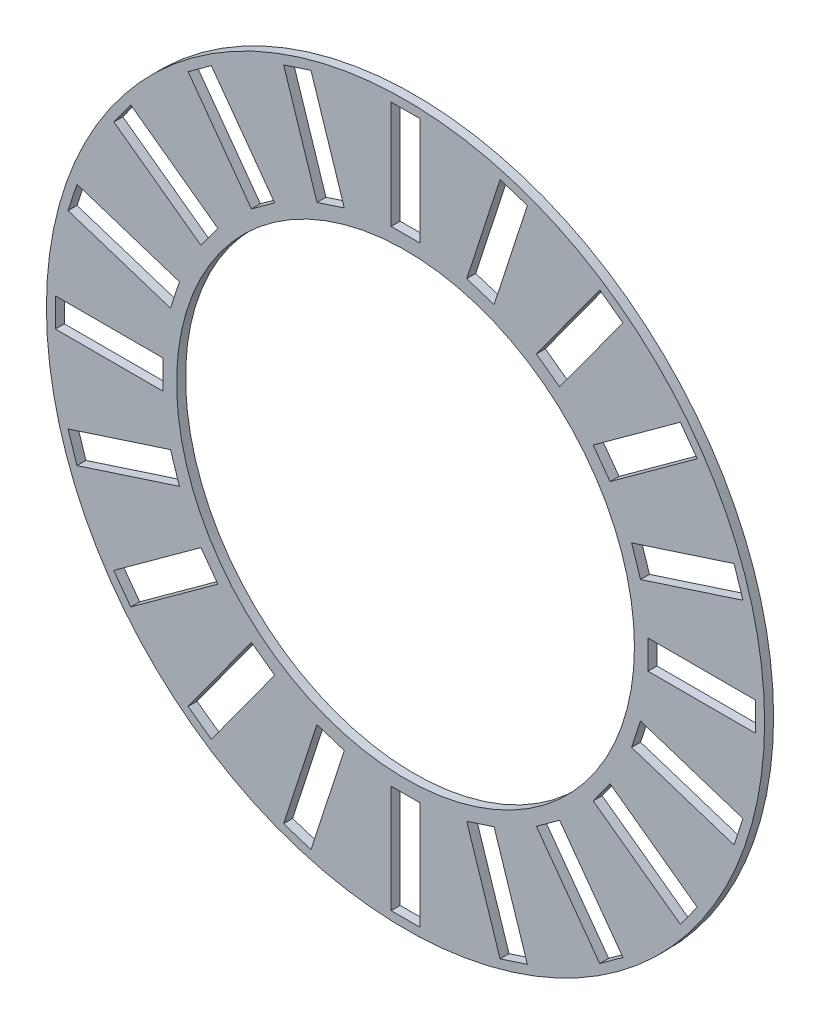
ISO-10303-21;
HEADER;
FILE_DESCRIPTION(('STEP AP214'),'2;1');
FILE_NAME('part.step','',(''),(''),'','','');
FILE_SCHEMA(('AUTOMOTIVE_DESIGN { 1 0 10303 214 1 1 1 1 }'));
ENDSEC;
DATA;
#1=APPLICATION_CONTEXT('core data for automotive mechanical design processes');
#2=APPLICATION_PROTOCOL_DEFINITION('international standard','automotive_design',2000,#1);
#3=PRODUCT_CONTEXT('',#1,'mechanical');
#4=PRODUCT('Part','Part','',(#3));
#5=PRODUCT_RELATED_PRODUCT_CATEGORY('part','',(#4));
#6=PRODUCT_DEFINITION_FORMATION('','',#4);
#7=PRODUCT_DEFINITION_CONTEXT('part definition',#1,'design');
#8=PRODUCT_DEFINITION('design','',#6,#7);
#9=PRODUCT_DEFINITION_SHAPE('','',#8);
#10=(LENGTH_UNIT() NAMED_UNIT(*) SI_UNIT(.MILLI.,.METRE.));
#11=(NAMED_UNIT(*) PLANE_ANGLE_UNIT() SI_UNIT($,.RADIAN.));
#12=(NAMED_UNIT(*) SI_UNIT($,.STERADIAN.) SOLID_ANGLE_UNIT());
#13=UNCERTAINTY_MEASURE_WITH_UNIT(LENGTH_MEASURE(1.E-05),#10,'distance_accuracy_value','');
#14=(GEOMETRIC_REPRESENTATION_CONTEXT(3) GLOBAL_UNCERTAINTY_ASSIGNED_CONTEXT((#13)) GLOBAL_UNIT_ASSIGNED_CONTEXT((#10,
#11,#12)) REPRESENTATION_CONTEXT('',''));
#15=CARTESIAN_POINT('',(0.,0.,0.));
#16=DIRECTION('',(0.,0.,1.));
#17=DIRECTION('',(1.,0.,0.));
#18=AXIS2_PLACEMENT_3D('',#15,#16,#17);
#19=CARTESIAN_POINT('',(0.,0.,0.25));
#20=DIRECTION('',(0.,0.,1.));
#21=DIRECTION('',(1.,0.,0.));
#22=AXIS2_PLACEMENT_3D('',#19,#20,#21);
#23=PLANE('',#22);
#24=DIRECTION('',(0.309016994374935,-0.951056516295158,0.));
#25=VECTOR('',#24,1.);
#26=CARTESIAN_POINT('',(12.5920493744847,4.93257463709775,0.25));
#27=LINE('',#26,#25);
#28=CARTESIAN_POINT('',(12.5920493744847,4.93257463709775,0.25));
#29=VERTEX_POINT('',#28);
#30=CARTESIAN_POINT('',(13.0864765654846,3.4108842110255,0.25));
#31=VERTEX_POINT('',#30);
#32=EDGE_CURVE('E365',#29,#31,#27,.T.);
#33=ORIENTED_EDGE('',*,*,#32,.F.);
#34=DIRECTION('',(-0.951056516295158,-0.309016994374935,0.));
#35=VECTOR('',#34,1.);
#36=CARTESIAN_POINT('',(12.5920493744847,4.93257463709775,0.25));
#37=LINE('',#36,#35);
#38=CARTESIAN_POINT('',(18.2983884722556,6.78667660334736,0.25));
#39=VERTEX_POINT('',#38);
#40=EDGE_CURVE('E864',#39,#29,#37,.T.);
#41=ORIENTED_EDGE('',*,*,#40,.F.);
#42=DIRECTION('',(-0.309016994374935,0.951056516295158,0.));
#43=VECTOR('',#42,1.);
#44=CARTESIAN_POINT('',(18.2983884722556,6.78667660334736,0.25));
#45=LINE('',#44,#43);
#46=CARTESIAN_POINT('',(18.7928156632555,5.26498617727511,0.25));
#47=VERTEX_POINT('',#46);
#48=EDGE_CURVE('E849',#47,#39,#45,.T.);
#49=ORIENTED_EDGE('',*,*,#48,.F.);
#50=DIRECTION('',(0.951056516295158,0.309016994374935,0.));
#51=VECTOR('',#50,1.);
#52=CARTESIAN_POINT('',(13.0864765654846,3.4108842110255,0.25));
#53=LINE('',#52,#51);
#54=EDGE_CURVE('E858',#31,#47,#53,.T.);
#55=ORIENTED_EDGE('',*,*,#54,.F.);
#56=EDGE_LOOP('',(#33,#41,#49,#55));
#57=FACE_BOUND('',#56,.T.);
#58=DIRECTION('',(0.587785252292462,-0.809016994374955,0.));
#59=VECTOR('',#58,1.);
#60=CARTESIAN_POINT('',(10.4515012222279,8.58231450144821,0.25));
#61=LINE('',#60,#59);
#62=CARTESIAN_POINT('',(10.4515012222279,8.58231450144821,0.25));
#63=VERTEX_POINT('',#62);
#64=CARTESIAN_POINT('',(11.3919576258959,7.28788731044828,0.25));
#65=VERTEX_POINT('',#64);
#66=EDGE_CURVE('E889',#63,#65,#61,.T.);
#67=ORIENTED_EDGE('',*,*,#66,.F.);
#68=DIRECTION('',(-0.809016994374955,-0.587785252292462,0.));
#69=VECTOR('',#68,1.);
#70=CARTESIAN_POINT('',(10.4515012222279,8.58231450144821,0.25));
#71=LINE('',#70,#69);
#72=CARTESIAN_POINT('',(15.3056031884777,12.109026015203,0.25));
#73=VERTEX_POINT('',#72);
#74=EDGE_CURVE('E904',#73,#63,#71,.T.);
#75=ORIENTED_EDGE('',*,*,#74,.F.);
#76=DIRECTION('',(-0.587785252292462,0.809016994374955,0.));
#77=VECTOR('',#76,1.);
#78=CARTESIAN_POINT('',(15.3056031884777,12.109026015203,0.25));
#79=LINE('',#78,#77);
#80=CARTESIAN_POINT('',(16.2460595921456,10.8145988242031,0.25));
#81=VERTEX_POINT('',#80);
#82=EDGE_CURVE('E908',#81,#73,#79,.T.);
#83=ORIENTED_EDGE('',*,*,#82,.F.);
#84=DIRECTION('',(0.809016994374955,0.587785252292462,0.));
#85=VECTOR('',#84,1.);
#86=CARTESIAN_POINT('',(11.3919576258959,7.28788731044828,0.25));
#87=LINE('',#86,#85);
#88=EDGE_CURVE('E911',#65,#81,#87,.T.);
#89=ORIENTED_EDGE('',*,*,#88,.F.);
#90=EDGE_LOOP('',(#67,#75,#83,#89));
#91=FACE_BOUND('',#90,.T.);
#92=DIRECTION('',(0.80901699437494,-0.587785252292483,0.));
#93=VECTOR('',#92,1.);
#94=CARTESIAN_POINT('',(7.28788731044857,11.3919576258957,0.25));
#95=LINE('',#94,#93);
#96=CARTESIAN_POINT('',(7.28788731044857,11.3919576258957,0.25));
#97=VERTEX_POINT('',#96);
#98=CARTESIAN_POINT('',(8.58231450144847,10.4515012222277,0.25));
#99=VERTEX_POINT('',#98);
#100=EDGE_CURVE('E907',#97,#99,#95,.T.);
#101=ORIENTED_EDGE('',*,*,#100,.F.);
#102=DIRECTION('',(-0.587785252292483,-0.80901699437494,0.));
#103=VECTOR('',#102,1.);
#104=CARTESIAN_POINT('',(7.28788731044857,11.3919576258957,0.25));
#105=LINE('',#104,#103);
#106=CARTESIAN_POINT('',(10.8145988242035,16.2460595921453,0.25));
#107=VERTEX_POINT('',#106);
#108=EDGE_CURVE('E922',#107,#97,#105,.T.);
#109=ORIENTED_EDGE('',*,*,#108,.F.);
#110=DIRECTION('',(-0.80901699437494,0.587785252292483,0.));
#111=VECTOR('',#110,1.);
#112=CARTESIAN_POINT('',(10.8145988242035,16.2460595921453,0.25));
#113=LINE('',#112,#111);
#114=CARTESIAN_POINT('',(12.1090260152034,15.3056031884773,0.25));
#115=VERTEX_POINT('',#114);
#116=EDGE_CURVE('E919',#115,#107,#113,.T.);
#117=ORIENTED_EDGE('',*,*,#116,.F.);
#118=DIRECTION('',(0.587785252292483,0.80901699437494,0.));
#119=VECTOR('',#118,1.);
#120=CARTESIAN_POINT('',(8.58231450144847,10.4515012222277,0.25));
#121=LINE('',#120,#119);
#122=EDGE_CURVE('E916',#99,#115,#121,.T.);
#123=ORIENTED_EDGE('',*,*,#122,.F.);
#124=EDGE_LOOP('',(#101,#109,#117,#123));
#125=FACE_BOUND('',#124,.T.);
#126=DIRECTION('',(0.95105651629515,-0.309016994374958,0.));
#127=VECTOR('',#126,1.);
#128=CARTESIAN_POINT('',(3.41088421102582,13.0864765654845,0.25));
#129=LINE('',#128,#127);
#130=CARTESIAN_POINT('',(3.41088421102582,13.0864765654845,0.25));
#131=VERTEX_POINT('',#130);
#132=CARTESIAN_POINT('',(4.93257463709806,12.5920493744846,0.25));
#133=VERTEX_POINT('',#132);
#134=EDGE_CURVE('E940',#131,#133,#129,.T.);
#135=ORIENTED_EDGE('',*,*,#134,.F.);
#136=DIRECTION('',(-0.309016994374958,-0.95105651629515,0.));
#137=VECTOR('',#136,1.);
#138=CARTESIAN_POINT('',(3.41088421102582,13.0864765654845,0.25));
#139=LINE('',#138,#137);
#140=CARTESIAN_POINT('',(5.26498617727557,18.7928156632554,0.25));
#141=VERTEX_POINT('',#140);
#142=EDGE_CURVE('E954',#141,#131,#139,.T.);
#143=ORIENTED_EDGE('',*,*,#142,.F.);
#144=DIRECTION('',(-0.95105651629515,0.309016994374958,0.));
#145=VECTOR('',#144,1.);
#146=CARTESIAN_POINT('',(5.26498617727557,18.7928156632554,0.25));
#147=LINE('',#146,#145);
#148=CARTESIAN_POINT('',(6.78667660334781,18.2983884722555,0.25));
#149=VERTEX_POINT('',#148);
#150=EDGE_CURVE('E951',#149,#141,#147,.T.);
#151=ORIENTED_EDGE('',*,*,#150,.F.);
#152=DIRECTION('',(0.309016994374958,0.95105651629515,0.));
#153=VECTOR('',#152,1.);
#154=CARTESIAN_POINT('',(4.93257463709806,12.5920493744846,0.25));
#155=LINE('',#154,#153);
#156=EDGE_CURVE('E948',#133,#149,#155,.T.);
#157=ORIENTED_EDGE('',*,*,#156,.F.);
#158=EDGE_LOOP('',(#135,#143,#151,#157));
#159=FACE_BOUND('',#158,.T.);
#160=DIRECTION('',(1.,0.,0.));
#161=VECTOR('',#160,1.);
#162=CARTESIAN_POINT('',(-0.799999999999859,13.5,0.25));
#163=LINE('',#162,#161);
#164=CARTESIAN_POINT('',(-0.799999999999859,13.5,0.25));
#165=VERTEX_POINT('',#164);
#166=CARTESIAN_POINT('',(0.800000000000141,13.5,0.25));
#167=VERTEX_POINT('',#166);
#168=EDGE_CURVE('E972',#165,#167,#163,.T.);
#169=ORIENTED_EDGE('',*,*,#168,.F.);
#170=DIRECTION('',(0.,-1.,0.));
#171=VECTOR('',#170,1.);
#172=CARTESIAN_POINT('',(-0.799999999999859,13.5,0.25));
#173=LINE('',#172,#171);
#174=CARTESIAN_POINT('',(-0.799999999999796,19.5,0.25));
#175=VERTEX_POINT('',#174);
#176=EDGE_CURVE('E986',#175,#165,#173,.T.);
#177=ORIENTED_EDGE('',*,*,#176,.F.);
#178=DIRECTION('',(-1.,0.,0.));
#179=VECTOR('',#178,1.);
#180=CARTESIAN_POINT('',(-0.799999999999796,19.5,0.25));
#181=LINE('',#180,#179);
#182=CARTESIAN_POINT('',(0.800000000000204,19.5,0.25));
#183=VERTEX_POINT('',#182);
#184=EDGE_CURVE('E983',#183,#175,#181,.T.);
#185=ORIENTED_EDGE('',*,*,#184,.F.);
#186=DIRECTION('',(0.,1.,0.));
#187=VECTOR('',#186,1.);
#188=CARTESIAN_POINT('',(0.800000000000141,13.5,0.25));
#189=LINE('',#188,#187);
#190=EDGE_CURVE('E980',#167,#183,#189,.T.);
#191=ORIENTED_EDGE('',*,*,#190,.F.);
#192=EDGE_LOOP('',(#169,#177,#185,#191));
#193=FACE_BOUND('',#192,.T.);
#194=DIRECTION('',(0.951056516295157,0.309016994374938,0.));
#195=VECTOR('',#194,1.);
#196=CARTESIAN_POINT('',(-4.93257463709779,12.5920493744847,0.25));
#197=LINE('',#196,#195);
#198=CARTESIAN_POINT('',(-4.93257463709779,12.5920493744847,0.25));
#199=VERTEX_POINT('',#198);
#200=CARTESIAN_POINT('',(-3.41088421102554,13.0864765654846,0.25));
#201=VERTEX_POINT('',#200);
#202=EDGE_CURVE('E1004',#199,#201,#197,.T.);
#203=ORIENTED_EDGE('',*,*,#202,.F.);
#204=DIRECTION('',(0.309016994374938,-0.951056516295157,0.));
#205=VECTOR('',#204,1.);
#206=CARTESIAN_POINT('',(-4.93257463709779,12.5920493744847,0.25));
#207=LINE('',#206,#205);
#208=CARTESIAN_POINT('',(-6.78667660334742,18.2983884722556,0.25));
#209=VERTEX_POINT('',#208);
#210=EDGE_CURVE('E1018',#209,#199,#207,.T.);
#211=ORIENTED_EDGE('',*,*,#210,.F.);
#212=DIRECTION('',(-0.951056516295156,-0.309016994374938,0.));
#213=VECTOR('',#212,1.);
#214=CARTESIAN_POINT('',(-6.78667660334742,18.2983884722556,0.25));
#215=LINE('',#214,#213);
#216=CARTESIAN_POINT('',(-5.26498617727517,18.7928156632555,0.25));
#217=VERTEX_POINT('',#216);
#218=EDGE_CURVE('E1015',#217,#209,#215,.T.);
#219=ORIENTED_EDGE('',*,*,#218,.F.);
#220=DIRECTION('',(-0.309016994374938,0.951056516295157,0.));
#221=VECTOR('',#220,1.);
#222=CARTESIAN_POINT('',(-3.41088421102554,13.0864765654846,0.25));
#223=LINE('',#222,#221);
#224=EDGE_CURVE('E1012',#201,#217,#223,.T.);
#225=ORIENTED_EDGE('',*,*,#224,.F.);
#226=EDGE_LOOP('',(#203,#211,#219,#225));
#227=FACE_BOUND('',#226,.T.);
#228=DIRECTION('',(0.809016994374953,0.587785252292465,0.));
#229=VECTOR('',#228,1.);
#230=CARTESIAN_POINT('',(-8.58231450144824,10.4515012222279,0.25));
#231=LINE('',#230,#229);
#232=CARTESIAN_POINT('',(-8.58231450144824,10.4515012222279,0.25));
#233=VERTEX_POINT('',#232);
#234=CARTESIAN_POINT('',(-7.28788731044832,11.3919576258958,0.25));
#235=VERTEX_POINT('',#234);
#236=EDGE_CURVE('E1049',#233,#235,#231,.T.);
#237=ORIENTED_EDGE('',*,*,#236,.F.);
#238=DIRECTION('',(0.587785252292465,-0.809016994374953,0.));
#239=VECTOR('',#238,1.);
#240=CARTESIAN_POINT('',(-8.58231450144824,10.4515012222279,0.25));
#241=LINE('',#240,#239);
#242=CARTESIAN_POINT('',(-12.109026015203,15.3056031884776,0.25));
#243=VERTEX_POINT('',#242);
#244=EDGE_CURVE('E1064',#243,#233,#241,.T.);
#245=ORIENTED_EDGE('',*,*,#244,.F.);
#246=DIRECTION('',(-0.809016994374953,-0.587785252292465,0.));
#247=VECTOR('',#246,1.);
#248=CARTESIAN_POINT('',(-12.109026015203,15.3056031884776,0.25));
#249=LINE('',#248,#247);
#250=CARTESIAN_POINT('',(-10.8145988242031,16.2460595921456,0.25));
#251=VERTEX_POINT('',#250);
#252=EDGE_CURVE('E1068',#251,#243,#249,.T.);
#253=ORIENTED_EDGE('',*,*,#252,.F.);
#254=DIRECTION('',(-0.587785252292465,0.809016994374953,0.));
#255=VECTOR('',#254,1.);
#256=CARTESIAN_POINT('',(-7.28788731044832,11.3919576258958,0.25));
#257=LINE('',#256,#255);
#258=EDGE_CURVE('E1071',#235,#251,#257,.T.);
#259=ORIENTED_EDGE('',*,*,#258,.F.);
#260=EDGE_LOOP('',(#237,#245,#253,#259));
#261=FACE_BOUND('',#260,.T.);
#262=DIRECTION('',(0.58778525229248,0.809016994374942,0.));
#263=VECTOR('',#262,1.);
#264=CARTESIAN_POINT('',(-11.3919576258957,7.28788731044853,0.25));
#265=LINE('',#264,#263);
#266=CARTESIAN_POINT('',(-11.3919576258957,7.28788731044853,0.25));
#267=VERTEX_POINT('',#266);
#268=CARTESIAN_POINT('',(-10.4515012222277,8.58231450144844,0.25));
#269=VERTEX_POINT('',#268);
#270=EDGE_CURVE('E1067',#267,#269,#265,.T.);
#271=ORIENTED_EDGE('',*,*,#270,.F.);
#272=DIRECTION('',(0.809016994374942,-0.58778525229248,0.));
#273=VECTOR('',#272,1.);
#274=CARTESIAN_POINT('',(-11.3919576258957,7.28788731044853,0.25));
#275=LINE('',#274,#273);
#276=CARTESIAN_POINT('',(-16.2460595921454,10.8145988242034,0.25));
#277=VERTEX_POINT('',#276);
#278=EDGE_CURVE('E1082',#277,#267,#275,.T.);
#279=ORIENTED_EDGE('',*,*,#278,.F.);
#280=DIRECTION('',(-0.58778525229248,-0.809016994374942,0.));
#281=VECTOR('',#280,1.);
#282=CARTESIAN_POINT('',(-16.2460595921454,10.8145988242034,0.25));
#283=LINE('',#282,#281);
#284=CARTESIAN_POINT('',(-15.3056031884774,12.1090260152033,0.25));
#285=VERTEX_POINT('',#284);
#286=EDGE_CURVE('E1079',#285,#277,#283,.T.);
#287=ORIENTED_EDGE('',*,*,#286,.F.);
#288=DIRECTION('',(-0.809016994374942,0.58778525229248,0.));
#289=VECTOR('',#288,1.);
#290=CARTESIAN_POINT('',(-10.4515012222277,8.58231450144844,0.25));
#291=LINE('',#290,#289);
#292=EDGE_CURVE('E1076',#269,#285,#291,.T.);
#293=ORIENTED_EDGE('',*,*,#292,.F.);
#294=EDGE_LOOP('',(#271,#279,#287,#293));
#295=FACE_BOUND('',#294,.T.);
#296=DIRECTION('',(0.309016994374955,0.951056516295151,0.));
#297=VECTOR('',#296,1.);
#298=CARTESIAN_POINT('',(-13.0864765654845,3.41088421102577,0.25));
#299=LINE('',#298,#297);
#300=CARTESIAN_POINT('',(-13.0864765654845,3.41088421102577,0.25));
#301=VERTEX_POINT('',#300);
#302=CARTESIAN_POINT('',(-12.5920493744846,4.93257463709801,0.25));
#303=VERTEX_POINT('',#302);
#304=EDGE_CURVE('E1100',#301,#303,#299,.T.);
#305=ORIENTED_EDGE('',*,*,#304,.F.);
#306=DIRECTION('',(0.951056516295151,-0.309016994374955,0.));
#307=VECTOR('',#306,1.);
#308=CARTESIAN_POINT('',(-13.0864765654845,3.41088421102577,0.25));
#309=LINE('',#308,#307);
#310=CARTESIAN_POINT('',(-18.7928156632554,5.2649861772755,0.25));
#311=VERTEX_POINT('',#310);
#312=EDGE_CURVE('E1114',#311,#301,#309,.T.);
#313=ORIENTED_EDGE('',*,*,#312,.F.);
#314=DIRECTION('',(-0.309016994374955,-0.951056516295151,0.));
#315=VECTOR('',#314,1.);
#316=CARTESIAN_POINT('',(-18.7928156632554,5.2649861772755,0.25));
#317=LINE('',#316,#315);
#318=CARTESIAN_POINT('',(-18.2983884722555,6.78667660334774,0.25));
#319=VERTEX_POINT('',#318);
#320=EDGE_CURVE('E1111',#319,#311,#317,.T.);
#321=ORIENTED_EDGE('',*,*,#320,.F.);
#322=DIRECTION('',(-0.951056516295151,0.309016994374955,0.));
#323=VECTOR('',#322,1.);
#324=CARTESIAN_POINT('',(-12.5920493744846,4.93257463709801,0.25));
#325=LINE('',#324,#323);
#326=EDGE_CURVE('E1108',#303,#319,#325,.T.);
#327=ORIENTED_EDGE('',*,*,#326,.F.);
#328=EDGE_LOOP('',(#305,#313,#321,#327));
#329=FACE_BOUND('',#328,.T.);
#330=DIRECTION('',(0.,1.,0.));
#331=VECTOR('',#330,1.);
#332=CARTESIAN_POINT('',(-13.5,-0.799999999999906,0.25));
#333=LINE('',#332,#331);
#334=CARTESIAN_POINT('',(-13.5,-0.799999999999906,0.25));
#335=VERTEX_POINT('',#334);
#336=CARTESIAN_POINT('',(-13.5,0.800000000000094,0.25));
#337=VERTEX_POINT('',#336);
#338=EDGE_CURVE('E1132',#335,#337,#333,.T.);
#339=ORIENTED_EDGE('',*,*,#338,.F.);
#340=DIRECTION('',(1.,0.,0.));
#341=VECTOR('',#340,1.);
#342=CARTESIAN_POINT('',(-13.5,-0.799999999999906,0.25));
#343=LINE('',#342,#341);
#344=CARTESIAN_POINT('',(-19.5,-0.799999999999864,0.25));
#345=VERTEX_POINT('',#344);
#346=EDGE_CURVE('E1146',#345,#335,#343,.T.);
#347=ORIENTED_EDGE('',*,*,#346,.F.);
#348=DIRECTION('',(0.,-1.,0.));
#349=VECTOR('',#348,1.);
#350=CARTESIAN_POINT('',(-19.5,-0.799999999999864,0.25));
#351=LINE('',#350,#349);
#352=CARTESIAN_POINT('',(-19.5,0.800000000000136,0.25));
#353=VERTEX_POINT('',#352);
#354=EDGE_CURVE('E1143',#353,#345,#351,.T.);
#355=ORIENTED_EDGE('',*,*,#354,.F.);
#356=DIRECTION('',(-1.,0.,0.));
#357=VECTOR('',#356,1.);
#358=CARTESIAN_POINT('',(-13.5,0.800000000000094,0.25));
#359=LINE('',#358,#357);
#360=EDGE_CURVE('E1140',#337,#353,#359,.T.);
#361=ORIENTED_EDGE('',*,*,#360,.F.);
#362=EDGE_LOOP('',(#339,#347,#355,#361));
#363=FACE_BOUND('',#362,.T.);
#364=DIRECTION('',(-0.309016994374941,0.951056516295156,0.));
#365=VECTOR('',#364,1.);
#366=CARTESIAN_POINT('',(-12.5920493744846,-4.93257463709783,0.25));
#367=LINE('',#366,#365);
#368=CARTESIAN_POINT('',(-12.5920493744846,-4.93257463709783,0.25));
#369=VERTEX_POINT('',#368);
#370=CARTESIAN_POINT('',(-13.0864765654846,-3.41088421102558,0.25));
#371=VERTEX_POINT('',#370);
#372=EDGE_CURVE('E1164',#369,#371,#367,.T.);
#373=ORIENTED_EDGE('',*,*,#372,.F.);
#374=DIRECTION('',(0.951056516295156,0.309016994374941,0.));
#375=VECTOR('',#374,1.);
#376=CARTESIAN_POINT('',(-12.5920493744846,-4.93257463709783,0.25));
#377=LINE('',#376,#375);
#378=CARTESIAN_POINT('',(-18.2983884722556,-6.78667660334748,0.25));
#379=VERTEX_POINT('',#378);
#380=EDGE_CURVE('E1178',#379,#369,#377,.T.);
#381=ORIENTED_EDGE('',*,*,#380,.F.);
#382=DIRECTION('',(0.309016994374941,-0.951056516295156,0.));
#383=VECTOR('',#382,1.);
#384=CARTESIAN_POINT('',(-18.2983884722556,-6.78667660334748,0.25));
#385=LINE('',#384,#383);
#386=CARTESIAN_POINT('',(-18.7928156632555,-5.26498617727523,0.25));
#387=VERTEX_POINT('',#386);
#388=EDGE_CURVE('E1175',#387,#379,#385,.T.);
#389=ORIENTED_EDGE('',*,*,#388,.F.);
#390=DIRECTION('',(-0.951056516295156,-0.309016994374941,0.));
#391=VECTOR('',#390,1.);
#392=CARTESIAN_POINT('',(-13.0864765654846,-3.41088421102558,0.25));
#393=LINE('',#392,#391);
#394=EDGE_CURVE('E1172',#371,#387,#393,.T.);
#395=ORIENTED_EDGE('',*,*,#394,.F.);
#396=EDGE_LOOP('',(#373,#381,#389,#395));
#397=FACE_BOUND('',#396,.T.);
#398=DIRECTION('',(-0.587785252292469,0.809016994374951,0.));
#399=VECTOR('',#398,1.);
#400=CARTESIAN_POINT('',(-10.4515012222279,-8.58231450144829,0.25));
#401=LINE('',#400,#399);
#402=CARTESIAN_POINT('',(-10.4515012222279,-8.58231450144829,0.25));
#403=VERTEX_POINT('',#402);
#404=CARTESIAN_POINT('',(-11.3919576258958,-7.28788731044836,0.25));
#405=VERTEX_POINT('',#404);
#406=EDGE_CURVE('E1209',#403,#405,#401,.T.);
#407=ORIENTED_EDGE('',*,*,#406,.F.);
#408=DIRECTION('',(0.809016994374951,0.587785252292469,0.));
#409=VECTOR('',#408,1.);
#410=CARTESIAN_POINT('',(-10.4515012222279,-8.58231450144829,0.25));
#411=LINE('',#410,#409);
#412=CARTESIAN_POINT('',(-15.3056031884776,-12.1090260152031,0.25));
#413=VERTEX_POINT('',#412);
#414=EDGE_CURVE('E1224',#413,#403,#411,.T.);
#415=ORIENTED_EDGE('',*,*,#414,.F.);
#416=DIRECTION('',(0.587785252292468,-0.809016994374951,0.));
#417=VECTOR('',#416,1.);
#418=CARTESIAN_POINT('',(-15.3056031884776,-12.1090260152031,0.25));
#419=LINE('',#418,#417);
#420=CARTESIAN_POINT('',(-16.2460595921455,-10.8145988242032,0.25));
#421=VERTEX_POINT('',#420);
#422=EDGE_CURVE('E1228',#421,#413,#419,.T.);
#423=ORIENTED_EDGE('',*,*,#422,.F.);
#424=DIRECTION('',(-0.809016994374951,-0.587785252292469,0.));
#425=VECTOR('',#424,1.);
#426=CARTESIAN_POINT('',(-11.3919576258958,-7.28788731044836,0.25));
#427=LINE('',#426,#425);
#428=EDGE_CURVE('E1231',#405,#421,#427,.T.);
#429=ORIENTED_EDGE('',*,*,#428,.F.);
#430=EDGE_LOOP('',(#407,#415,#423,#429));
#431=FACE_BOUND('',#430,.T.);
#432=DIRECTION('',(-0.809016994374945,0.587785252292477,0.));
#433=VECTOR('',#432,1.);
#434=CARTESIAN_POINT('',(-7.28788731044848,-11.3919576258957,0.25));
#435=LINE('',#434,#433);
#436=CARTESIAN_POINT('',(-7.28788731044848,-11.3919576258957,0.25));
#437=VERTEX_POINT('',#436);
#438=CARTESIAN_POINT('',(-8.58231450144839,-10.4515012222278,0.25));
#439=VERTEX_POINT('',#438);
#440=EDGE_CURVE('E1227',#437,#439,#435,.T.);
#441=ORIENTED_EDGE('',*,*,#440,.F.);
#442=DIRECTION('',(0.587785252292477,0.809016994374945,0.));
#443=VECTOR('',#442,1.);
#444=CARTESIAN_POINT('',(-7.28788731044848,-11.3919576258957,0.25));
#445=LINE('',#444,#443);
#446=CARTESIAN_POINT('',(-10.8145988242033,-16.2460595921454,0.25));
#447=VERTEX_POINT('',#446);
#448=EDGE_CURVE('E1242',#447,#437,#445,.T.);
#449=ORIENTED_EDGE('',*,*,#448,.F.);
#450=DIRECTION('',(0.809016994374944,-0.587785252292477,0.));
#451=VECTOR('',#450,1.);
#452=CARTESIAN_POINT('',(-10.8145988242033,-16.2460595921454,0.25));
#453=LINE('',#452,#451);
#454=CARTESIAN_POINT('',(-12.1090260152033,-15.3056031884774,0.25));
#455=VERTEX_POINT('',#454);
#456=EDGE_CURVE('E1239',#455,#447,#453,.T.);
#457=ORIENTED_EDGE('',*,*,#456,.F.);
#458=DIRECTION('',(-0.587785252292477,-0.809016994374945,0.));
#459=VECTOR('',#458,1.);
#460=CARTESIAN_POINT('',(-8.5823145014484,-10.4515012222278,0.25));
#461=LINE('',#460,#459);
#462=EDGE_CURVE('E1236',#439,#455,#461,.T.);
#463=ORIENTED_EDGE('',*,*,#462,.F.);
#464=EDGE_LOOP('',(#441,#449,#457,#463));
#465=FACE_BOUND('',#464,.T.);
#466=DIRECTION('',(-0.951056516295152,0.309016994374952,0.));
#467=VECTOR('',#466,1.);
#468=CARTESIAN_POINT('',(-3.41088421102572,-13.0864765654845,0.25));
#469=LINE('',#468,#467);
#470=CARTESIAN_POINT('',(-3.41088421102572,-13.0864765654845,0.25));
#471=VERTEX_POINT('',#470);
#472=CARTESIAN_POINT('',(-4.93257463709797,-12.5920493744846,0.25));
#473=VERTEX_POINT('',#472);
#474=EDGE_CURVE('E1260',#471,#473,#469,.T.);
#475=ORIENTED_EDGE('',*,*,#474,.F.);
#476=DIRECTION('',(0.309016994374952,0.951056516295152,0.));
#477=VECTOR('',#476,1.);
#478=CARTESIAN_POINT('',(-3.41088421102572,-13.0864765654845,0.25));
#479=LINE('',#478,#477);
#480=CARTESIAN_POINT('',(-5.26498617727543,-18.7928156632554,0.25));
#481=VERTEX_POINT('',#480);
#482=EDGE_CURVE('E1274',#481,#471,#479,.T.);
#483=ORIENTED_EDGE('',*,*,#482,.F.);
#484=DIRECTION('',(0.951056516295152,-0.309016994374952,0.));
#485=VECTOR('',#484,1.);
#486=CARTESIAN_POINT('',(-5.26498617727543,-18.7928156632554,0.25));
#487=LINE('',#486,#485);
#488=CARTESIAN_POINT('',(-6.78667660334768,-18.2983884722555,0.25));
#489=VERTEX_POINT('',#488);
#490=EDGE_CURVE('E1271',#489,#481,#487,.T.);
#491=ORIENTED_EDGE('',*,*,#490,.F.);
#492=DIRECTION('',(-0.309016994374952,-0.951056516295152,0.));
#493=VECTOR('',#492,1.);
#494=CARTESIAN_POINT('',(-4.93257463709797,-12.5920493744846,0.25));
#495=LINE('',#494,#493);
#496=EDGE_CURVE('E1268',#473,#489,#495,.T.);
#497=ORIENTED_EDGE('',*,*,#496,.F.);
#498=EDGE_LOOP('',(#475,#483,#491,#497));
#499=FACE_BOUND('',#498,.T.);
#500=DIRECTION('',(-1.,0.,0.));
#501=VECTOR('',#500,1.);
#502=CARTESIAN_POINT('',(0.799999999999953,-13.5,0.25));
#503=LINE('',#502,#501);
#504=CARTESIAN_POINT('',(0.799999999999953,-13.5,0.25));
#505=VERTEX_POINT('',#504);
#506=CARTESIAN_POINT('',(-0.800000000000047,-13.5,0.25));
#507=VERTEX_POINT('',#506);
#508=EDGE_CURVE('E1292',#505,#507,#503,.T.);
#509=ORIENTED_EDGE('',*,*,#508,.F.);
#510=DIRECTION('',(0.,1.,0.));
#511=VECTOR('',#510,1.);
#512=CARTESIAN_POINT('',(0.799999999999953,-13.5,0.25));
#513=LINE('',#512,#511);
#514=CARTESIAN_POINT('',(0.799999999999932,-19.5,0.25));
#515=VERTEX_POINT('',#514);
#516=EDGE_CURVE('E1306',#515,#505,#513,.T.);
#517=ORIENTED_EDGE('',*,*,#516,.F.);
#518=DIRECTION('',(1.,0.,0.));
#519=VECTOR('',#518,1.);
#520=CARTESIAN_POINT('',(0.799999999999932,-19.5,0.25));
#521=LINE('',#520,#519);
#522=CARTESIAN_POINT('',(-0.800000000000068,-19.5,0.25));
#523=VERTEX_POINT('',#522);
#524=EDGE_CURVE('E1303',#523,#515,#521,.T.);
#525=ORIENTED_EDGE('',*,*,#524,.F.);
#526=DIRECTION('',(0.,-1.,0.));
#527=VECTOR('',#526,1.);
#528=CARTESIAN_POINT('',(-0.800000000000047,-13.5,0.25));
#529=LINE('',#528,#527);
#530=EDGE_CURVE('E1300',#507,#523,#529,.T.);
#531=ORIENTED_EDGE('',*,*,#530,.F.);
#532=EDGE_LOOP('',(#509,#517,#525,#531));
#533=FACE_BOUND('',#532,.T.);
#534=DIRECTION('',(-0.951056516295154,-0.309016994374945,0.));
#535=VECTOR('',#534,1.);
#536=CARTESIAN_POINT('',(4.93257463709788,-12.5920493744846,0.25));
#537=LINE('',#536,#535);
#538=CARTESIAN_POINT('',(4.93257463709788,-12.5920493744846,0.25));
#539=VERTEX_POINT('',#538);
#540=CARTESIAN_POINT('',(3.41088421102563,-13.0864765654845,0.25));
#541=VERTEX_POINT('',#540);
#542=EDGE_CURVE('E1324',#539,#541,#537,.T.);
#543=ORIENTED_EDGE('',*,*,#542,.F.);
#544=DIRECTION('',(-0.309016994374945,0.951056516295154,0.));
#545=VECTOR('',#544,1.);
#546=CARTESIAN_POINT('',(4.93257463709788,-12.5920493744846,0.25));
#547=LINE('',#546,#545);
#548=CARTESIAN_POINT('',(6.78667660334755,-18.2983884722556,0.25));
#549=VERTEX_POINT('',#548);
#550=EDGE_CURVE('E1338',#549,#539,#547,.T.);
#551=ORIENTED_EDGE('',*,*,#550,.F.);
#552=DIRECTION('',(0.951056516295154,0.309016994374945,0.));
#553=VECTOR('',#552,1.);
#554=CARTESIAN_POINT('',(6.78667660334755,-18.2983884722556,0.25));
#555=LINE('',#554,#553);
#556=CARTESIAN_POINT('',(5.2649861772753,-18.7928156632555,0.25));
#557=VERTEX_POINT('',#556);
#558=EDGE_CURVE('E1335',#557,#549,#555,.T.);
#559=ORIENTED_EDGE('',*,*,#558,.F.);
#560=DIRECTION('',(0.309016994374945,-0.951056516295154,0.));
#561=VECTOR('',#560,1.);
#562=CARTESIAN_POINT('',(3.41088421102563,-13.0864765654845,0.25));
#563=LINE('',#562,#561);
#564=EDGE_CURVE('E1332',#541,#557,#563,.T.);
#565=ORIENTED_EDGE('',*,*,#564,.F.);
#566=EDGE_LOOP('',(#543,#551,#559,#565));
#567=FACE_BOUND('',#566,.T.);
#568=DIRECTION('',(-0.809016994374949,-0.587785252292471,0.));
#569=VECTOR('',#568,1.);
#570=CARTESIAN_POINT('',(8.58231450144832,-10.4515012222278,0.25));
#571=LINE('',#570,#569);
#572=CARTESIAN_POINT('',(8.58231450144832,-10.4515012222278,0.25));
#573=VERTEX_POINT('',#572);
#574=CARTESIAN_POINT('',(7.2878873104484,-11.3919576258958,0.25));
#575=VERTEX_POINT('',#574);
#576=EDGE_CURVE('E1369',#573,#575,#571,.T.);
#577=ORIENTED_EDGE('',*,*,#576,.F.);
#578=DIRECTION('',(-0.587785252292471,0.809016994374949,0.));
#579=VECTOR('',#578,1.);
#580=CARTESIAN_POINT('',(8.58231450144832,-10.4515012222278,0.25));
#581=LINE('',#580,#579);
#582=CARTESIAN_POINT('',(12.1090260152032,-15.3056031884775,0.25));
#583=VERTEX_POINT('',#582);
#584=EDGE_CURVE('E1384',#583,#573,#581,.T.);
#585=ORIENTED_EDGE('',*,*,#584,.F.);
#586=DIRECTION('',(0.809016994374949,0.587785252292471,0.));
#587=VECTOR('',#586,1.);
#588=CARTESIAN_POINT('',(12.1090260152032,-15.3056031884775,0.25));
#589=LINE('',#588,#587);
#590=CARTESIAN_POINT('',(10.8145988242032,-16.2460595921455,0.25));
#591=VERTEX_POINT('',#590);
#592=EDGE_CURVE('E1388',#591,#583,#589,.T.);
#593=ORIENTED_EDGE('',*,*,#592,.F.);
#594=DIRECTION('',(0.587785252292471,-0.809016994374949,0.));
#595=VECTOR('',#594,1.);
#596=CARTESIAN_POINT('',(7.2878873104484,-11.3919576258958,0.25));
#597=LINE('',#596,#595);
#598=EDGE_CURVE('E1391',#575,#591,#597,.T.);
#599=ORIENTED_EDGE('',*,*,#598,.F.);
#600=EDGE_LOOP('',(#577,#585,#593,#599));
#601=FACE_BOUND('',#600,.T.);
#602=DIRECTION('',(-0.587785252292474,-0.809016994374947,0.));
#603=VECTOR('',#602,1.);
#604=CARTESIAN_POINT('',(11.3919576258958,-7.28788731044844,0.25));
#605=LINE('',#604,#603);
#606=CARTESIAN_POINT('',(11.3919576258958,-7.28788731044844,0.25));
#607=VERTEX_POINT('',#606);
#608=CARTESIAN_POINT('',(10.4515012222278,-8.58231450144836,0.25));
#609=VERTEX_POINT('',#608);
#610=EDGE_CURVE('E1387',#607,#609,#605,.T.);
#611=ORIENTED_EDGE('',*,*,#610,.F.);
#612=DIRECTION('',(-0.809016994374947,0.587785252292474,0.));
#613=VECTOR('',#612,1.);
#614=CARTESIAN_POINT('',(11.3919576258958,-7.28788731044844,0.25));
#615=LINE('',#614,#613);
#616=CARTESIAN_POINT('',(16.2460595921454,-10.8145988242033,0.25));
#617=VERTEX_POINT('',#616);
#618=EDGE_CURVE('E1402',#617,#607,#615,.T.);
#619=ORIENTED_EDGE('',*,*,#618,.F.);
#620=DIRECTION('',(0.587785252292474,0.809016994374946,0.));
#621=VECTOR('',#620,1.);
#622=CARTESIAN_POINT('',(16.2460595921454,-10.8145988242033,0.25));
#623=LINE('',#622,#621);
#624=CARTESIAN_POINT('',(15.3056031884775,-12.1090260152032,0.25));
#625=VERTEX_POINT('',#624);
#626=EDGE_CURVE('E1399',#625,#617,#623,.T.);
#627=ORIENTED_EDGE('',*,*,#626,.F.);
#628=DIRECTION('',(0.809016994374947,-0.587785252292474,0.));
#629=VECTOR('',#628,1.);
#630=CARTESIAN_POINT('',(10.4515012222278,-8.58231450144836,0.25));
#631=LINE('',#630,#629);
#632=EDGE_CURVE('E1396',#609,#625,#631,.T.);
#633=ORIENTED_EDGE('',*,*,#632,.F.);
#634=EDGE_LOOP('',(#611,#619,#627,#633));
#635=FACE_BOUND('',#634,.T.);
#636=DIRECTION('',(-0.309016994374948,-0.951056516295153,0.));
#637=VECTOR('',#636,1.);
#638=CARTESIAN_POINT('',(13.0864765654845,-3.41088421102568,0.25));
#639=LINE('',#638,#637);
#640=CARTESIAN_POINT('',(13.0864765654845,-3.41088421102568,0.25));
#641=VERTEX_POINT('',#640);
#642=CARTESIAN_POINT('',(12.5920493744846,-4.93257463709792,0.25));
#643=VERTEX_POINT('',#642);
#644=EDGE_CURVE('E1420',#641,#643,#639,.T.);
#645=ORIENTED_EDGE('',*,*,#644,.F.);
#646=DIRECTION('',(-0.951056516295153,0.309016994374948,0.));
#647=VECTOR('',#646,1.);
#648=CARTESIAN_POINT('',(13.0864765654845,-3.41088421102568,0.25));
#649=LINE('',#648,#647);
#650=CARTESIAN_POINT('',(18.7928156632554,-5.26498617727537,0.25));
#651=VERTEX_POINT('',#650);
#652=EDGE_CURVE('E1434',#651,#641,#649,.T.);
#653=ORIENTED_EDGE('',*,*,#652,.F.);
#654=DIRECTION('',(0.309016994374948,0.951056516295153,0.));
#655=VECTOR('',#654,1.);
#656=CARTESIAN_POINT('',(18.7928156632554,-5.26498617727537,0.25));
#657=LINE('',#656,#655);
#658=CARTESIAN_POINT('',(18.2983884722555,-6.78667660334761,0.25));
#659=VERTEX_POINT('',#658);
#660=EDGE_CURVE('E1431',#659,#651,#657,.T.);
#661=ORIENTED_EDGE('',*,*,#660,.F.);
#662=DIRECTION('',(0.951056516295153,-0.309016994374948,0.));
#663=VECTOR('',#662,1.);
#664=CARTESIAN_POINT('',(12.5920493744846,-4.93257463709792,0.25));
#665=LINE('',#664,#663);
#666=EDGE_CURVE('E1428',#643,#659,#665,.T.);
#667=ORIENTED_EDGE('',*,*,#666,.F.);
#668=EDGE_LOOP('',(#645,#653,#661,#667));
#669=FACE_BOUND('',#668,.T.);
#670=DIRECTION('',(0.,-1.,0.));
#671=VECTOR('',#670,1.);
#672=CARTESIAN_POINT('',(13.5,0.8,0.25));
#673=LINE('',#672,#671);
#674=CARTESIAN_POINT('',(13.5,0.8,0.25));
#675=VERTEX_POINT('',#674);
#676=CARTESIAN_POINT('',(13.5,-0.8,0.25));
#677=VERTEX_POINT('',#676);
#678=EDGE_CURVE('E1452',#675,#677,#673,.T.);
#679=ORIENTED_EDGE('',*,*,#678,.F.);
#680=DIRECTION('',(-1.,0.,0.));
#681=VECTOR('',#680,1.);
#682=CARTESIAN_POINT('',(13.5,0.8,0.25));
#683=LINE('',#682,#681);
#684=CARTESIAN_POINT('',(19.5,0.8,0.25));
#685=VERTEX_POINT('',#684);
#686=EDGE_CURVE('E1466',#685,#675,#683,.T.);
#687=ORIENTED_EDGE('',*,*,#686,.F.);
#688=DIRECTION('',(0.,1.,0.));
#689=VECTOR('',#688,1.);
#690=CARTESIAN_POINT('',(19.5,0.8,0.25));
#691=LINE('',#690,#689);
#692=CARTESIAN_POINT('',(19.5,-0.8,0.25));
#693=VERTEX_POINT('',#692);
#694=EDGE_CURVE('E1463',#693,#685,#691,.T.);
#695=ORIENTED_EDGE('',*,*,#694,.F.);
#696=DIRECTION('',(1.,0.,0.));
#697=VECTOR('',#696,1.);
#698=CARTESIAN_POINT('',(13.5,-0.8,0.25));
#699=LINE('',#698,#697);
#700=EDGE_CURVE('E1460',#677,#693,#699,.T.);
#701=ORIENTED_EDGE('',*,*,#700,.F.);
#702=EDGE_LOOP('',(#679,#687,#695,#701));
#703=FACE_BOUND('',#702,.T.);
#704=CARTESIAN_POINT('',(0.,0.,0.25));
#705=DIRECTION('',(0.,0.,1.));
#706=DIRECTION('',(1.,0.,0.));
#707=AXIS2_PLACEMENT_3D('',#704,#705,#706);
#708=CIRCLE('',#707,20.);
#709=CARTESIAN_POINT('',(20.,0.,0.25));
#710=VERTEX_POINT('',#709);
#711=EDGE_CURVE('E11',#710,#710,#708,.T.);
#712=ORIENTED_EDGE('',*,*,#711,.T.);
#713=EDGE_LOOP('',(#712));
#714=FACE_BOUND('',#713,.T.);
#715=CARTESIAN_POINT('',(0.,0.,0.25));
#716=DIRECTION('',(0.,0.,1.));
#717=DIRECTION('',(1.,0.,0.));
#718=AXIS2_PLACEMENT_3D('',#715,#716,#717);
#719=CIRCLE('',#718,12.75);
#720=CARTESIAN_POINT('',(12.75,0.,0.25));
#721=VERTEX_POINT('',#720);
#722=EDGE_CURVE('E1493',#721,#721,#719,.T.);
#723=ORIENTED_EDGE('',*,*,#722,.F.);
#724=EDGE_LOOP('',(#723));
#725=FACE_BOUND('',#724,.T.);
#726=ADVANCED_FACE('F350',(#57,#91,#125,#159,#193,#227,#261,#295,#329,#363,#397,#431,#465,#499,
#533,#567,#601,#635,#669,#703,#714,#725),#23,.T.);
#727=CARTESIAN_POINT('',(0.,0.,-0.25));
#728=DIRECTION('',(0.,0.,1.));
#729=DIRECTION('',(1.,0.,0.));
#730=AXIS2_PLACEMENT_3D('',#727,#728,#729);
#731=PLANE('',#730);
#732=DIRECTION('',(-0.951056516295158,-0.309016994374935,0.));
#733=VECTOR('',#732,1.);
#734=CARTESIAN_POINT('',(12.5920493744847,4.93257463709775,-0.25));
#735=LINE('',#734,#733);
#736=CARTESIAN_POINT('',(18.2983884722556,6.78667660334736,-0.25));
#737=VERTEX_POINT('',#736);
#738=CARTESIAN_POINT('',(12.5920493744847,4.93257463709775,-0.25));
#739=VERTEX_POINT('',#738);
#740=EDGE_CURVE('E875',#737,#739,#735,.T.);
#741=ORIENTED_EDGE('',*,*,#740,.T.);
#742=DIRECTION('',(0.309016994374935,-0.951056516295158,0.));
#743=VECTOR('',#742,1.);
#744=CARTESIAN_POINT('',(12.5920493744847,4.93257463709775,-0.25));
#745=LINE('',#744,#743);
#746=CARTESIAN_POINT('',(13.0864765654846,3.4108842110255,-0.25));
#747=VERTEX_POINT('',#746);
#748=EDGE_CURVE('E866',#739,#747,#745,.T.);
#749=ORIENTED_EDGE('',*,*,#748,.T.);
#750=DIRECTION('',(0.951056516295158,0.309016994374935,0.));
#751=VECTOR('',#750,1.);
#752=CARTESIAN_POINT('',(13.0864765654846,3.4108842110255,-0.25));
#753=LINE('',#752,#751);
#754=CARTESIAN_POINT('',(18.7928156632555,5.26498617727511,-0.25));
#755=VERTEX_POINT('',#754);
#756=EDGE_CURVE('E872',#747,#755,#753,.T.);
#757=ORIENTED_EDGE('',*,*,#756,.T.);
#758=DIRECTION('',(-0.309016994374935,0.951056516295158,0.));
#759=VECTOR('',#758,1.);
#760=CARTESIAN_POINT('',(18.2983884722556,6.78667660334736,-0.25));
#761=LINE('',#760,#759);
#762=EDGE_CURVE('E373',#755,#737,#761,.T.);
#763=ORIENTED_EDGE('',*,*,#762,.T.);
#764=EDGE_LOOP('',(#741,#749,#757,#763));
#765=FACE_BOUND('',#764,.T.);
#766=DIRECTION('',(-0.809016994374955,-0.587785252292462,0.));
#767=VECTOR('',#766,1.);
#768=CARTESIAN_POINT('',(10.4515012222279,8.58231450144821,-0.25));
#769=LINE('',#768,#767);
#770=CARTESIAN_POINT('',(15.3056031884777,12.109026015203,-0.25));
#771=VERTEX_POINT('',#770);
#772=CARTESIAN_POINT('',(10.4515012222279,8.58231450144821,-0.25));
#773=VERTEX_POINT('',#772);
#774=EDGE_CURVE('E886',#771,#773,#769,.T.);
#775=ORIENTED_EDGE('',*,*,#774,.T.);
#776=DIRECTION('',(0.587785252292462,-0.809016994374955,0.));
#777=VECTOR('',#776,1.);
#778=CARTESIAN_POINT('',(10.4515012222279,8.58231450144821,-0.25));
#779=LINE('',#778,#777);
#780=CARTESIAN_POINT('',(11.3919576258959,7.28788731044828,-0.25));
#781=VERTEX_POINT('',#780);
#782=EDGE_CURVE('E880',#773,#781,#779,.T.);
#783=ORIENTED_EDGE('',*,*,#782,.T.);
#784=DIRECTION('',(0.809016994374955,0.587785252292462,0.));
#785=VECTOR('',#784,1.);
#786=CARTESIAN_POINT('',(11.3919576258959,7.28788731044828,-0.25));
#787=LINE('',#786,#785);
#788=CARTESIAN_POINT('',(16.2460595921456,10.8145988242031,-0.25));
#789=VERTEX_POINT('',#788);
#790=EDGE_CURVE('E890',#781,#789,#787,.T.);
#791=ORIENTED_EDGE('',*,*,#790,.T.);
#792=DIRECTION('',(-0.587785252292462,0.809016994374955,0.));
#793=VECTOR('',#792,1.);
#794=CARTESIAN_POINT('',(15.3056031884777,12.109026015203,-0.25));
#795=LINE('',#794,#793);
#796=EDGE_CURVE('E893',#789,#771,#795,.T.);
#797=ORIENTED_EDGE('',*,*,#796,.T.);
#798=EDGE_LOOP('',(#775,#783,#791,#797));
#799=FACE_BOUND('',#798,.T.);
#800=DIRECTION('',(-0.587785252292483,-0.80901699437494,0.));
#801=VECTOR('',#800,1.);
#802=CARTESIAN_POINT('',(7.28788731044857,11.3919576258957,-0.25));
#803=LINE('',#802,#801);
#804=CARTESIAN_POINT('',(10.8145988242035,16.2460595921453,-0.25));
#805=VERTEX_POINT('',#804);
#806=CARTESIAN_POINT('',(7.28788731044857,11.3919576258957,-0.25));
#807=VERTEX_POINT('',#806);
#808=EDGE_CURVE('E934',#805,#807,#803,.T.);
#809=ORIENTED_EDGE('',*,*,#808,.T.);
#810=DIRECTION('',(0.80901699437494,-0.587785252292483,0.));
#811=VECTOR('',#810,1.);
#812=CARTESIAN_POINT('',(7.28788731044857,11.3919576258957,-0.25));
#813=LINE('',#812,#811);
#814=CARTESIAN_POINT('',(8.58231450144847,10.4515012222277,-0.25));
#815=VERTEX_POINT('',#814);
#816=EDGE_CURVE('E925',#807,#815,#813,.T.);
#817=ORIENTED_EDGE('',*,*,#816,.T.);
#818=DIRECTION('',(0.587785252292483,0.80901699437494,0.));
#819=VECTOR('',#818,1.);
#820=CARTESIAN_POINT('',(8.58231450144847,10.4515012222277,-0.25));
#821=LINE('',#820,#819);
#822=CARTESIAN_POINT('',(12.1090260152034,15.3056031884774,-0.25));
#823=VERTEX_POINT('',#822);
#824=EDGE_CURVE('E928',#815,#823,#821,.T.);
#825=ORIENTED_EDGE('',*,*,#824,.T.);
#826=DIRECTION('',(-0.80901699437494,0.587785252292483,0.));
#827=VECTOR('',#826,1.);
#828=CARTESIAN_POINT('',(10.8145988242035,16.2460595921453,-0.25));
#829=LINE('',#828,#827);
#830=EDGE_CURVE('E931',#823,#805,#829,.T.);
#831=ORIENTED_EDGE('',*,*,#830,.T.);
#832=EDGE_LOOP('',(#809,#817,#825,#831));
#833=FACE_BOUND('',#832,.T.);
#834=DIRECTION('',(-0.309016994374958,-0.95105651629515,0.));
#835=VECTOR('',#834,1.);
#836=CARTESIAN_POINT('',(3.41088421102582,13.0864765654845,-0.25));
#837=LINE('',#836,#835);
#838=CARTESIAN_POINT('',(5.26498617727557,18.7928156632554,-0.25));
#839=VERTEX_POINT('',#838);
#840=CARTESIAN_POINT('',(3.41088421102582,13.0864765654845,-0.25));
#841=VERTEX_POINT('',#840);
#842=EDGE_CURVE('E966',#839,#841,#837,.T.);
#843=ORIENTED_EDGE('',*,*,#842,.T.);
#844=DIRECTION('',(0.95105651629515,-0.309016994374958,0.));
#845=VECTOR('',#844,1.);
#846=CARTESIAN_POINT('',(3.41088421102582,13.0864765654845,-0.25));
#847=LINE('',#846,#845);
#848=CARTESIAN_POINT('',(4.93257463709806,12.5920493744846,-0.25));
#849=VERTEX_POINT('',#848);
#850=EDGE_CURVE('E957',#841,#849,#847,.T.);
#851=ORIENTED_EDGE('',*,*,#850,.T.);
#852=DIRECTION('',(0.309016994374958,0.95105651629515,0.));
#853=VECTOR('',#852,1.);
#854=CARTESIAN_POINT('',(4.93257463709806,12.5920493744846,-0.25));
#855=LINE('',#854,#853);
#856=CARTESIAN_POINT('',(6.78667660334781,18.2983884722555,-0.25));
#857=VERTEX_POINT('',#856);
#858=EDGE_CURVE('E960',#849,#857,#855,.T.);
#859=ORIENTED_EDGE('',*,*,#858,.T.);
#860=DIRECTION('',(-0.95105651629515,0.309016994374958,0.));
#861=VECTOR('',#860,1.);
#862=CARTESIAN_POINT('',(5.26498617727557,18.7928156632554,-0.25));
#863=LINE('',#862,#861);
#864=EDGE_CURVE('E963',#857,#839,#863,.T.);
#865=ORIENTED_EDGE('',*,*,#864,.T.);
#866=EDGE_LOOP('',(#843,#851,#859,#865));
#867=FACE_BOUND('',#866,.T.);
#868=DIRECTION('',(0.,-1.,0.));
#869=VECTOR('',#868,1.);
#870=CARTESIAN_POINT('',(-0.799999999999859,13.5,-0.25));
#871=LINE('',#870,#869);
#872=CARTESIAN_POINT('',(-0.799999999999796,19.5,-0.25));
#873=VERTEX_POINT('',#872);
#874=CARTESIAN_POINT('',(-0.799999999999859,13.5,-0.25));
#875=VERTEX_POINT('',#874);
#876=EDGE_CURVE('E998',#873,#875,#871,.T.);
#877=ORIENTED_EDGE('',*,*,#876,.T.);
#878=DIRECTION('',(1.,0.,0.));
#879=VECTOR('',#878,1.);
#880=CARTESIAN_POINT('',(-0.799999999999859,13.5,-0.25));
#881=LINE('',#880,#879);
#882=CARTESIAN_POINT('',(0.800000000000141,13.5,-0.25));
#883=VERTEX_POINT('',#882);
#884=EDGE_CURVE('E989',#875,#883,#881,.T.);
#885=ORIENTED_EDGE('',*,*,#884,.T.);
#886=DIRECTION('',(0.,1.,0.));
#887=VECTOR('',#886,1.);
#888=CARTESIAN_POINT('',(0.800000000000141,13.5,-0.25));
#889=LINE('',#888,#887);
#890=CARTESIAN_POINT('',(0.800000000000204,19.5,-0.25));
#891=VERTEX_POINT('',#890);
#892=EDGE_CURVE('E992',#883,#891,#889,.T.);
#893=ORIENTED_EDGE('',*,*,#892,.T.);
#894=DIRECTION('',(-1.,0.,0.));
#895=VECTOR('',#894,1.);
#896=CARTESIAN_POINT('',(-0.799999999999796,19.5,-0.25));
#897=LINE('',#896,#895);
#898=EDGE_CURVE('E995',#891,#873,#897,.T.);
#899=ORIENTED_EDGE('',*,*,#898,.T.);
#900=EDGE_LOOP('',(#877,#885,#893,#899));
#901=FACE_BOUND('',#900,.T.);
#902=DIRECTION('',(0.309016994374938,-0.951056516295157,0.));
#903=VECTOR('',#902,1.);
#904=CARTESIAN_POINT('',(-4.93257463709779,12.5920493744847,-0.25));
#905=LINE('',#904,#903);
#906=CARTESIAN_POINT('',(-6.78667660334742,18.2983884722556,-0.25));
#907=VERTEX_POINT('',#906);
#908=CARTESIAN_POINT('',(-4.93257463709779,12.5920493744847,-0.25));
#909=VERTEX_POINT('',#908);
#910=EDGE_CURVE('E1030',#907,#909,#905,.T.);
#911=ORIENTED_EDGE('',*,*,#910,.T.);
#912=DIRECTION('',(0.951056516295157,0.309016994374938,0.));
#913=VECTOR('',#912,1.);
#914=CARTESIAN_POINT('',(-4.93257463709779,12.5920493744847,-0.25));
#915=LINE('',#914,#913);
#916=CARTESIAN_POINT('',(-3.41088421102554,13.0864765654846,-0.25));
#917=VERTEX_POINT('',#916);
#918=EDGE_CURVE('E1021',#909,#917,#915,.T.);
#919=ORIENTED_EDGE('',*,*,#918,.T.);
#920=DIRECTION('',(-0.309016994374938,0.951056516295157,0.));
#921=VECTOR('',#920,1.);
#922=CARTESIAN_POINT('',(-3.41088421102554,13.0864765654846,-0.25));
#923=LINE('',#922,#921);
#924=CARTESIAN_POINT('',(-5.26498617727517,18.7928156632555,-0.25));
#925=VERTEX_POINT('',#924);
#926=EDGE_CURVE('E1024',#917,#925,#923,.T.);
#927=ORIENTED_EDGE('',*,*,#926,.T.);
#928=DIRECTION('',(-0.951056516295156,-0.309016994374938,0.));
#929=VECTOR('',#928,1.);
#930=CARTESIAN_POINT('',(-6.78667660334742,18.2983884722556,-0.25));
#931=LINE('',#930,#929);
#932=EDGE_CURVE('E1027',#925,#907,#931,.T.);
#933=ORIENTED_EDGE('',*,*,#932,.T.);
#934=EDGE_LOOP('',(#911,#919,#927,#933));
#935=FACE_BOUND('',#934,.T.);
#936=DIRECTION('',(0.587785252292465,-0.809016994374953,0.));
#937=VECTOR('',#936,1.);
#938=CARTESIAN_POINT('',(-8.58231450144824,10.4515012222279,-0.25));
#939=LINE('',#938,#937);
#940=CARTESIAN_POINT('',(-12.109026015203,15.3056031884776,-0.25));
#941=VERTEX_POINT('',#940);
#942=CARTESIAN_POINT('',(-8.58231450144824,10.4515012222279,-0.25));
#943=VERTEX_POINT('',#942);
#944=EDGE_CURVE('E1046',#941,#943,#939,.T.);
#945=ORIENTED_EDGE('',*,*,#944,.T.);
#946=DIRECTION('',(0.809016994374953,0.587785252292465,0.));
#947=VECTOR('',#946,1.);
#948=CARTESIAN_POINT('',(-8.58231450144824,10.4515012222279,-0.25));
#949=LINE('',#948,#947);
#950=CARTESIAN_POINT('',(-7.28788731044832,11.3919576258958,-0.25));
#951=VERTEX_POINT('',#950);
#952=EDGE_CURVE('E1036',#943,#951,#949,.T.);
#953=ORIENTED_EDGE('',*,*,#952,.T.);
#954=DIRECTION('',(-0.587785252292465,0.809016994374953,0.));
#955=VECTOR('',#954,1.);
#956=CARTESIAN_POINT('',(-7.28788731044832,11.3919576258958,-0.25));
#957=LINE('',#956,#955);
#958=CARTESIAN_POINT('',(-10.8145988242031,16.2460595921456,-0.25));
#959=VERTEX_POINT('',#958);
#960=EDGE_CURVE('E1050',#951,#959,#957,.T.);
#961=ORIENTED_EDGE('',*,*,#960,.T.);
#962=DIRECTION('',(-0.809016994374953,-0.587785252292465,0.));
#963=VECTOR('',#962,1.);
#964=CARTESIAN_POINT('',(-12.109026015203,15.3056031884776,-0.25));
#965=LINE('',#964,#963);
#966=EDGE_CURVE('E1053',#959,#941,#965,.T.);
#967=ORIENTED_EDGE('',*,*,#966,.T.);
#968=EDGE_LOOP('',(#945,#953,#961,#967));
#969=FACE_BOUND('',#968,.T.);
#970=DIRECTION('',(0.809016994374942,-0.58778525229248,0.));
#971=VECTOR('',#970,1.);
#972=CARTESIAN_POINT('',(-11.3919576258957,7.28788731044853,-0.25));
#973=LINE('',#972,#971);
#974=CARTESIAN_POINT('',(-16.2460595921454,10.8145988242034,-0.25));
#975=VERTEX_POINT('',#974);
#976=CARTESIAN_POINT('',(-11.3919576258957,7.28788731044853,-0.25));
#977=VERTEX_POINT('',#976);
#978=EDGE_CURVE('E1094',#975,#977,#973,.T.);
#979=ORIENTED_EDGE('',*,*,#978,.T.);
#980=DIRECTION('',(0.58778525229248,0.809016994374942,0.));
#981=VECTOR('',#980,1.);
#982=CARTESIAN_POINT('',(-11.3919576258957,7.28788731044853,-0.25));
#983=LINE('',#982,#981);
#984=CARTESIAN_POINT('',(-10.4515012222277,8.58231450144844,-0.25));
#985=VERTEX_POINT('',#984);
#986=EDGE_CURVE('E1085',#977,#985,#983,.T.);
#987=ORIENTED_EDGE('',*,*,#986,.T.);
#988=DIRECTION('',(-0.809016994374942,0.58778525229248,0.));
#989=VECTOR('',#988,1.);
#990=CARTESIAN_POINT('',(-10.4515012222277,8.58231450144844,-0.25));
#991=LINE('',#990,#989);
#992=CARTESIAN_POINT('',(-15.3056031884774,12.1090260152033,-0.25));
#993=VERTEX_POINT('',#992);
#994=EDGE_CURVE('E1088',#985,#993,#991,.T.);
#995=ORIENTED_EDGE('',*,*,#994,.T.);
#996=DIRECTION('',(-0.58778525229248,-0.809016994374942,0.));
#997=VECTOR('',#996,1.);
#998=CARTESIAN_POINT('',(-16.2460595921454,10.8145988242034,-0.25));
#999=LINE('',#998,#997);
#1000=EDGE_CURVE('E1091',#993,#975,#999,.T.);
#1001=ORIENTED_EDGE('',*,*,#1000,.T.);
#1002=EDGE_LOOP('',(#979,#987,#995,#1001));
#1003=FACE_BOUND('',#1002,.T.);
#1004=DIRECTION('',(0.951056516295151,-0.309016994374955,0.));
#1005=VECTOR('',#1004,1.);
#1006=CARTESIAN_POINT('',(-13.0864765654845,3.41088421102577,-0.25));
#1007=LINE('',#1006,#1005);
#1008=CARTESIAN_POINT('',(-18.7928156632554,5.2649861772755,-0.25));
#1009=VERTEX_POINT('',#1008);
#1010=CARTESIAN_POINT('',(-13.0864765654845,3.41088421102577,-0.25));
#1011=VERTEX_POINT('',#1010);
#1012=EDGE_CURVE('E1126',#1009,#1011,#1007,.T.);
#1013=ORIENTED_EDGE('',*,*,#1012,.T.);
#1014=DIRECTION('',(0.309016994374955,0.951056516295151,0.));
#1015=VECTOR('',#1014,1.);
#1016=CARTESIAN_POINT('',(-13.0864765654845,3.41088421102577,-0.25));
#1017=LINE('',#1016,#1015);
#1018=CARTESIAN_POINT('',(-12.5920493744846,4.93257463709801,-0.25));
#1019=VERTEX_POINT('',#1018);
#1020=EDGE_CURVE('E1117',#1011,#1019,#1017,.T.);
#1021=ORIENTED_EDGE('',*,*,#1020,.T.);
#1022=DIRECTION('',(-0.951056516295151,0.309016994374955,0.));
#1023=VECTOR('',#1022,1.);
#1024=CARTESIAN_POINT('',(-12.5920493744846,4.93257463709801,-0.25));
#1025=LINE('',#1024,#1023);
#1026=CARTESIAN_POINT('',(-18.2983884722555,6.78667660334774,-0.25));
#1027=VERTEX_POINT('',#1026);
#1028=EDGE_CURVE('E1120',#1019,#1027,#1025,.T.);
#1029=ORIENTED_EDGE('',*,*,#1028,.T.);
#1030=DIRECTION('',(-0.309016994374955,-0.951056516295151,0.));
#1031=VECTOR('',#1030,1.);
#1032=CARTESIAN_POINT('',(-18.7928156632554,5.2649861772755,-0.25));
#1033=LINE('',#1032,#1031);
#1034=EDGE_CURVE('E1123',#1027,#1009,#1033,.T.);
#1035=ORIENTED_EDGE('',*,*,#1034,.T.);
#1036=EDGE_LOOP('',(#1013,#1021,#1029,#1035));
#1037=FACE_BOUND('',#1036,.T.);
#1038=DIRECTION('',(1.,0.,0.));
#1039=VECTOR('',#1038,1.);
#1040=CARTESIAN_POINT('',(-13.5,-0.799999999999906,-0.25));
#1041=LINE('',#1040,#1039);
#1042=CARTESIAN_POINT('',(-19.5,-0.799999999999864,-0.25));
#1043=VERTEX_POINT('',#1042);
#1044=CARTESIAN_POINT('',(-13.5,-0.799999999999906,-0.25));
#1045=VERTEX_POINT('',#1044);
#1046=EDGE_CURVE('E1158',#1043,#1045,#1041,.T.);
#1047=ORIENTED_EDGE('',*,*,#1046,.T.);
#1048=DIRECTION('',(0.,1.,0.));
#1049=VECTOR('',#1048,1.);
#1050=CARTESIAN_POINT('',(-13.5,-0.799999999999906,-0.25));
#1051=LINE('',#1050,#1049);
#1052=CARTESIAN_POINT('',(-13.5,0.800000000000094,-0.25));
#1053=VERTEX_POINT('',#1052);
#1054=EDGE_CURVE('E1149',#1045,#1053,#1051,.T.);
#1055=ORIENTED_EDGE('',*,*,#1054,.T.);
#1056=DIRECTION('',(-1.,0.,0.));
#1057=VECTOR('',#1056,1.);
#1058=CARTESIAN_POINT('',(-13.5,0.800000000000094,-0.25));
#1059=LINE('',#1058,#1057);
#1060=CARTESIAN_POINT('',(-19.5,0.800000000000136,-0.25));
#1061=VERTEX_POINT('',#1060);
#1062=EDGE_CURVE('E1152',#1053,#1061,#1059,.T.);
#1063=ORIENTED_EDGE('',*,*,#1062,.T.);
#1064=DIRECTION('',(0.,-1.,0.));
#1065=VECTOR('',#1064,1.);
#1066=CARTESIAN_POINT('',(-19.5,-0.799999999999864,-0.25));
#1067=LINE('',#1066,#1065);
#1068=EDGE_CURVE('E1155',#1061,#1043,#1067,.T.);
#1069=ORIENTED_EDGE('',*,*,#1068,.T.);
#1070=EDGE_LOOP('',(#1047,#1055,#1063,#1069));
#1071=FACE_BOUND('',#1070,.T.);
#1072=DIRECTION('',(0.951056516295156,0.309016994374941,0.));
#1073=VECTOR('',#1072,1.);
#1074=CARTESIAN_POINT('',(-12.5920493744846,-4.93257463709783,-0.25));
#1075=LINE('',#1074,#1073);
#1076=CARTESIAN_POINT('',(-18.2983884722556,-6.78667660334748,-0.25));
#1077=VERTEX_POINT('',#1076);
#1078=CARTESIAN_POINT('',(-12.5920493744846,-4.93257463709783,-0.25));
#1079=VERTEX_POINT('',#1078);
#1080=EDGE_CURVE('E1190',#1077,#1079,#1075,.T.);
#1081=ORIENTED_EDGE('',*,*,#1080,.T.);
#1082=DIRECTION('',(-0.309016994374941,0.951056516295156,0.));
#1083=VECTOR('',#1082,1.);
#1084=CARTESIAN_POINT('',(-12.5920493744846,-4.93257463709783,-0.25));
#1085=LINE('',#1084,#1083);
#1086=CARTESIAN_POINT('',(-13.0864765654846,-3.41088421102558,-0.25));
#1087=VERTEX_POINT('',#1086);
#1088=EDGE_CURVE('E1181',#1079,#1087,#1085,.T.);
#1089=ORIENTED_EDGE('',*,*,#1088,.T.);
#1090=DIRECTION('',(-0.951056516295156,-0.309016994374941,0.));
#1091=VECTOR('',#1090,1.);
#1092=CARTESIAN_POINT('',(-13.0864765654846,-3.41088421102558,-0.25));
#1093=LINE('',#1092,#1091);
#1094=CARTESIAN_POINT('',(-18.7928156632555,-5.26498617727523,-0.25));
#1095=VERTEX_POINT('',#1094);
#1096=EDGE_CURVE('E1184',#1087,#1095,#1093,.T.);
#1097=ORIENTED_EDGE('',*,*,#1096,.T.);
#1098=DIRECTION('',(0.309016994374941,-0.951056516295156,0.));
#1099=VECTOR('',#1098,1.);
#1100=CARTESIAN_POINT('',(-18.2983884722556,-6.78667660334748,-0.25));
#1101=LINE('',#1100,#1099);
#1102=EDGE_CURVE('E1187',#1095,#1077,#1101,.T.);
#1103=ORIENTED_EDGE('',*,*,#1102,.T.);
#1104=EDGE_LOOP('',(#1081,#1089,#1097,#1103));
#1105=FACE_BOUND('',#1104,.T.);
#1106=DIRECTION('',(0.809016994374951,0.587785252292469,0.));
#1107=VECTOR('',#1106,1.);
#1108=CARTESIAN_POINT('',(-10.4515012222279,-8.58231450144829,-0.25));
#1109=LINE('',#1108,#1107);
#1110=CARTESIAN_POINT('',(-15.3056031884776,-12.1090260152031,-0.25));
#1111=VERTEX_POINT('',#1110);
#1112=CARTESIAN_POINT('',(-10.4515012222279,-8.58231450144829,-0.25));
#1113=VERTEX_POINT('',#1112);
#1114=EDGE_CURVE('E1206',#1111,#1113,#1109,.T.);
#1115=ORIENTED_EDGE('',*,*,#1114,.T.);
#1116=DIRECTION('',(-0.587785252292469,0.809016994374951,0.));
#1117=VECTOR('',#1116,1.);
#1118=CARTESIAN_POINT('',(-10.4515012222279,-8.58231450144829,-0.25));
#1119=LINE('',#1118,#1117);
#1120=CARTESIAN_POINT('',(-11.3919576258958,-7.28788731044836,-0.25));
#1121=VERTEX_POINT('',#1120);
#1122=EDGE_CURVE('E1196',#1113,#1121,#1119,.T.);
#1123=ORIENTED_EDGE('',*,*,#1122,.T.);
#1124=DIRECTION('',(-0.809016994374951,-0.587785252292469,0.));
#1125=VECTOR('',#1124,1.);
#1126=CARTESIAN_POINT('',(-11.3919576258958,-7.28788731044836,-0.25));
#1127=LINE('',#1126,#1125);
#1128=CARTESIAN_POINT('',(-16.2460595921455,-10.8145988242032,-0.25));
#1129=VERTEX_POINT('',#1128);
#1130=EDGE_CURVE('E1210',#1121,#1129,#1127,.T.);
#1131=ORIENTED_EDGE('',*,*,#1130,.T.);
#1132=DIRECTION('',(0.587785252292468,-0.809016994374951,0.));
#1133=VECTOR('',#1132,1.);
#1134=CARTESIAN_POINT('',(-15.3056031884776,-12.1090260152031,-0.25));
#1135=LINE('',#1134,#1133);
#1136=EDGE_CURVE('E1213',#1129,#1111,#1135,.T.);
#1137=ORIENTED_EDGE('',*,*,#1136,.T.);
#1138=EDGE_LOOP('',(#1115,#1123,#1131,#1137));
#1139=FACE_BOUND('',#1138,.T.);
#1140=DIRECTION('',(0.587785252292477,0.809016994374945,0.));
#1141=VECTOR('',#1140,1.);
#1142=CARTESIAN_POINT('',(-7.28788731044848,-11.3919576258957,-0.25));
#1143=LINE('',#1142,#1141);
#1144=CARTESIAN_POINT('',(-10.8145988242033,-16.2460595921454,-0.25));
#1145=VERTEX_POINT('',#1144);
#1146=CARTESIAN_POINT('',(-7.28788731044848,-11.3919576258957,-0.25));
#1147=VERTEX_POINT('',#1146);
#1148=EDGE_CURVE('E1254',#1145,#1147,#1143,.T.);
#1149=ORIENTED_EDGE('',*,*,#1148,.T.);
#1150=DIRECTION('',(-0.809016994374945,0.587785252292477,0.));
#1151=VECTOR('',#1150,1.);
#1152=CARTESIAN_POINT('',(-7.28788731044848,-11.3919576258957,-0.25));
#1153=LINE('',#1152,#1151);
#1154=CARTESIAN_POINT('',(-8.5823145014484,-10.4515012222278,-0.25));
#1155=VERTEX_POINT('',#1154);
#1156=EDGE_CURVE('E1245',#1147,#1155,#1153,.T.);
#1157=ORIENTED_EDGE('',*,*,#1156,.T.);
#1158=DIRECTION('',(-0.587785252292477,-0.809016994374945,0.));
#1159=VECTOR('',#1158,1.);
#1160=CARTESIAN_POINT('',(-8.5823145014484,-10.4515012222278,-0.25));
#1161=LINE('',#1160,#1159);
#1162=CARTESIAN_POINT('',(-12.1090260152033,-15.3056031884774,-0.25));
#1163=VERTEX_POINT('',#1162);
#1164=EDGE_CURVE('E1248',#1155,#1163,#1161,.T.);
#1165=ORIENTED_EDGE('',*,*,#1164,.T.);
#1166=DIRECTION('',(0.809016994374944,-0.587785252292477,0.));
#1167=VECTOR('',#1166,1.);
#1168=CARTESIAN_POINT('',(-10.8145988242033,-16.2460595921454,-0.25));
#1169=LINE('',#1168,#1167);
#1170=EDGE_CURVE('E1251',#1163,#1145,#1169,.T.);
#1171=ORIENTED_EDGE('',*,*,#1170,.T.);
#1172=EDGE_LOOP('',(#1149,#1157,#1165,#1171));
#1173=FACE_BOUND('',#1172,.T.);
#1174=DIRECTION('',(0.309016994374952,0.951056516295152,0.));
#1175=VECTOR('',#1174,1.);
#1176=CARTESIAN_POINT('',(-3.41088421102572,-13.0864765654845,-0.25));
#1177=LINE('',#1176,#1175);
#1178=CARTESIAN_POINT('',(-5.26498617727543,-18.7928156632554,-0.25));
#1179=VERTEX_POINT('',#1178);
#1180=CARTESIAN_POINT('',(-3.41088421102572,-13.0864765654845,-0.25));
#1181=VERTEX_POINT('',#1180);
#1182=EDGE_CURVE('E1286',#1179,#1181,#1177,.T.);
#1183=ORIENTED_EDGE('',*,*,#1182,.T.);
#1184=DIRECTION('',(-0.951056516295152,0.309016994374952,0.));
#1185=VECTOR('',#1184,1.);
#1186=CARTESIAN_POINT('',(-3.41088421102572,-13.0864765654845,-0.25));
#1187=LINE('',#1186,#1185);
#1188=CARTESIAN_POINT('',(-4.93257463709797,-12.5920493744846,-0.25));
#1189=VERTEX_POINT('',#1188);
#1190=EDGE_CURVE('E1277',#1181,#1189,#1187,.T.);
#1191=ORIENTED_EDGE('',*,*,#1190,.T.);
#1192=DIRECTION('',(-0.309016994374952,-0.951056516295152,0.));
#1193=VECTOR('',#1192,1.);
#1194=CARTESIAN_POINT('',(-4.93257463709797,-12.5920493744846,-0.25));
#1195=LINE('',#1194,#1193);
#1196=CARTESIAN_POINT('',(-6.78667660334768,-18.2983884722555,-0.25));
#1197=VERTEX_POINT('',#1196);
#1198=EDGE_CURVE('E1280',#1189,#1197,#1195,.T.);
#1199=ORIENTED_EDGE('',*,*,#1198,.T.);
#1200=DIRECTION('',(0.951056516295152,-0.309016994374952,0.));
#1201=VECTOR('',#1200,1.);
#1202=CARTESIAN_POINT('',(-5.26498617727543,-18.7928156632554,-0.25));
#1203=LINE('',#1202,#1201);
#1204=EDGE_CURVE('E1283',#1197,#1179,#1203,.T.);
#1205=ORIENTED_EDGE('',*,*,#1204,.T.);
#1206=EDGE_LOOP('',(#1183,#1191,#1199,#1205));
#1207=FACE_BOUND('',#1206,.T.);
#1208=DIRECTION('',(0.,1.,0.));
#1209=VECTOR('',#1208,1.);
#1210=CARTESIAN_POINT('',(0.799999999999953,-13.5,-0.25));
#1211=LINE('',#1210,#1209);
#1212=CARTESIAN_POINT('',(0.799999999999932,-19.5,-0.25));
#1213=VERTEX_POINT('',#1212);
#1214=CARTESIAN_POINT('',(0.799999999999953,-13.5,-0.25));
#1215=VERTEX_POINT('',#1214);
#1216=EDGE_CURVE('E1318',#1213,#1215,#1211,.T.);
#1217=ORIENTED_EDGE('',*,*,#1216,.T.);
#1218=DIRECTION('',(-1.,0.,0.));
#1219=VECTOR('',#1218,1.);
#1220=CARTESIAN_POINT('',(0.799999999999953,-13.5,-0.25));
#1221=LINE('',#1220,#1219);
#1222=CARTESIAN_POINT('',(-0.800000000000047,-13.5,-0.25));
#1223=VERTEX_POINT('',#1222);
#1224=EDGE_CURVE('E1309',#1215,#1223,#1221,.T.);
#1225=ORIENTED_EDGE('',*,*,#1224,.T.);
#1226=DIRECTION('',(0.,-1.,0.));
#1227=VECTOR('',#1226,1.);
#1228=CARTESIAN_POINT('',(-0.800000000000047,-13.5,-0.25));
#1229=LINE('',#1228,#1227);
#1230=CARTESIAN_POINT('',(-0.800000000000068,-19.5,-0.25));
#1231=VERTEX_POINT('',#1230);
#1232=EDGE_CURVE('E1312',#1223,#1231,#1229,.T.);
#1233=ORIENTED_EDGE('',*,*,#1232,.T.);
#1234=DIRECTION('',(1.,0.,0.));
#1235=VECTOR('',#1234,1.);
#1236=CARTESIAN_POINT('',(0.799999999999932,-19.5,-0.25));
#1237=LINE('',#1236,#1235);
#1238=EDGE_CURVE('E1315',#1231,#1213,#1237,.T.);
#1239=ORIENTED_EDGE('',*,*,#1238,.T.);
#1240=EDGE_LOOP('',(#1217,#1225,#1233,#1239));
#1241=FACE_BOUND('',#1240,.T.);
#1242=DIRECTION('',(-0.309016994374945,0.951056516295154,0.));
#1243=VECTOR('',#1242,1.);
#1244=CARTESIAN_POINT('',(4.93257463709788,-12.5920493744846,-0.25));
#1245=LINE('',#1244,#1243);
#1246=CARTESIAN_POINT('',(6.78667660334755,-18.2983884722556,-0.25));
#1247=VERTEX_POINT('',#1246);
#1248=CARTESIAN_POINT('',(4.93257463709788,-12.5920493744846,-0.25));
#1249=VERTEX_POINT('',#1248);
#1250=EDGE_CURVE('E1350',#1247,#1249,#1245,.T.);
#1251=ORIENTED_EDGE('',*,*,#1250,.T.);
#1252=DIRECTION('',(-0.951056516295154,-0.309016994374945,0.));
#1253=VECTOR('',#1252,1.);
#1254=CARTESIAN_POINT('',(4.93257463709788,-12.5920493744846,-0.25));
#1255=LINE('',#1254,#1253);
#1256=CARTESIAN_POINT('',(3.41088421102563,-13.0864765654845,-0.25));
#1257=VERTEX_POINT('',#1256);
#1258=EDGE_CURVE('E1341',#1249,#1257,#1255,.T.);
#1259=ORIENTED_EDGE('',*,*,#1258,.T.);
#1260=DIRECTION('',(0.309016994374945,-0.951056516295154,0.));
#1261=VECTOR('',#1260,1.);
#1262=CARTESIAN_POINT('',(3.41088421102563,-13.0864765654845,-0.25));
#1263=LINE('',#1262,#1261);
#1264=CARTESIAN_POINT('',(5.2649861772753,-18.7928156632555,-0.25));
#1265=VERTEX_POINT('',#1264);
#1266=EDGE_CURVE('E1344',#1257,#1265,#1263,.T.);
#1267=ORIENTED_EDGE('',*,*,#1266,.T.);
#1268=DIRECTION('',(0.951056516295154,0.309016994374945,0.));
#1269=VECTOR('',#1268,1.);
#1270=CARTESIAN_POINT('',(6.78667660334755,-18.2983884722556,-0.25));
#1271=LINE('',#1270,#1269);
#1272=EDGE_CURVE('E1347',#1265,#1247,#1271,.T.);
#1273=ORIENTED_EDGE('',*,*,#1272,.T.);
#1274=EDGE_LOOP('',(#1251,#1259,#1267,#1273));
#1275=FACE_BOUND('',#1274,.T.);
#1276=DIRECTION('',(-0.587785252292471,0.809016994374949,0.));
#1277=VECTOR('',#1276,1.);
#1278=CARTESIAN_POINT('',(8.58231450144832,-10.4515012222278,-0.25));
#1279=LINE('',#1278,#1277);
#1280=CARTESIAN_POINT('',(12.1090260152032,-15.3056031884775,-0.25));
#1281=VERTEX_POINT('',#1280);
#1282=CARTESIAN_POINT('',(8.58231450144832,-10.4515012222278,-0.25));
#1283=VERTEX_POINT('',#1282);
#1284=EDGE_CURVE('E1366',#1281,#1283,#1279,.T.);
#1285=ORIENTED_EDGE('',*,*,#1284,.T.);
#1286=DIRECTION('',(-0.809016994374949,-0.587785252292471,0.));
#1287=VECTOR('',#1286,1.);
#1288=CARTESIAN_POINT('',(8.58231450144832,-10.4515012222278,-0.25));
#1289=LINE('',#1288,#1287);
#1290=CARTESIAN_POINT('',(7.2878873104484,-11.3919576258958,-0.25));
#1291=VERTEX_POINT('',#1290);
#1292=EDGE_CURVE('E1356',#1283,#1291,#1289,.T.);
#1293=ORIENTED_EDGE('',*,*,#1292,.T.);
#1294=DIRECTION('',(0.587785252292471,-0.809016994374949,0.));
#1295=VECTOR('',#1294,1.);
#1296=CARTESIAN_POINT('',(7.2878873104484,-11.3919576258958,-0.25));
#1297=LINE('',#1296,#1295);
#1298=CARTESIAN_POINT('',(10.8145988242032,-16.2460595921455,-0.25));
#1299=VERTEX_POINT('',#1298);
#1300=EDGE_CURVE('E1370',#1291,#1299,#1297,.T.);
#1301=ORIENTED_EDGE('',*,*,#1300,.T.);
#1302=DIRECTION('',(0.809016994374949,0.587785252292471,0.));
#1303=VECTOR('',#1302,1.);
#1304=CARTESIAN_POINT('',(12.1090260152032,-15.3056031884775,-0.25));
#1305=LINE('',#1304,#1303);
#1306=EDGE_CURVE('E1373',#1299,#1281,#1305,.T.);
#1307=ORIENTED_EDGE('',*,*,#1306,.T.);
#1308=EDGE_LOOP('',(#1285,#1293,#1301,#1307));
#1309=FACE_BOUND('',#1308,.T.);
#1310=DIRECTION('',(-0.809016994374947,0.587785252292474,0.));
#1311=VECTOR('',#1310,1.);
#1312=CARTESIAN_POINT('',(11.3919576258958,-7.28788731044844,-0.25));
#1313=LINE('',#1312,#1311);
#1314=CARTESIAN_POINT('',(16.2460595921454,-10.8145988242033,-0.25));
#1315=VERTEX_POINT('',#1314);
#1316=CARTESIAN_POINT('',(11.3919576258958,-7.28788731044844,-0.25));
#1317=VERTEX_POINT('',#1316);
#1318=EDGE_CURVE('E1414',#1315,#1317,#1313,.T.);
#1319=ORIENTED_EDGE('',*,*,#1318,.T.);
#1320=DIRECTION('',(-0.587785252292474,-0.809016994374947,0.));
#1321=VECTOR('',#1320,1.);
#1322=CARTESIAN_POINT('',(11.3919576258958,-7.28788731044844,-0.25));
#1323=LINE('',#1322,#1321);
#1324=CARTESIAN_POINT('',(10.4515012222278,-8.58231450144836,-0.25));
#1325=VERTEX_POINT('',#1324);
#1326=EDGE_CURVE('E1405',#1317,#1325,#1323,.T.);
#1327=ORIENTED_EDGE('',*,*,#1326,.T.);
#1328=DIRECTION('',(0.809016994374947,-0.587785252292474,0.));
#1329=VECTOR('',#1328,1.);
#1330=CARTESIAN_POINT('',(10.4515012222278,-8.58231450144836,-0.25));
#1331=LINE('',#1330,#1329);
#1332=CARTESIAN_POINT('',(15.3056031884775,-12.1090260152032,-0.25));
#1333=VERTEX_POINT('',#1332);
#1334=EDGE_CURVE('E1408',#1325,#1333,#1331,.T.);
#1335=ORIENTED_EDGE('',*,*,#1334,.T.);
#1336=DIRECTION('',(0.587785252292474,0.809016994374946,0.));
#1337=VECTOR('',#1336,1.);
#1338=CARTESIAN_POINT('',(16.2460595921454,-10.8145988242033,-0.25));
#1339=LINE('',#1338,#1337);
#1340=EDGE_CURVE('E1411',#1333,#1315,#1339,.T.);
#1341=ORIENTED_EDGE('',*,*,#1340,.T.);
#1342=EDGE_LOOP('',(#1319,#1327,#1335,#1341));
#1343=FACE_BOUND('',#1342,.T.);
#1344=DIRECTION('',(-0.951056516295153,0.309016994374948,0.));
#1345=VECTOR('',#1344,1.);
#1346=CARTESIAN_POINT('',(13.0864765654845,-3.41088421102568,-0.25));
#1347=LINE('',#1346,#1345);
#1348=CARTESIAN_POINT('',(18.7928156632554,-5.26498617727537,-0.25));
#1349=VERTEX_POINT('',#1348);
#1350=CARTESIAN_POINT('',(13.0864765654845,-3.41088421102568,-0.25));
#1351=VERTEX_POINT('',#1350);
#1352=EDGE_CURVE('E1446',#1349,#1351,#1347,.T.);
#1353=ORIENTED_EDGE('',*,*,#1352,.T.);
#1354=DIRECTION('',(-0.309016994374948,-0.951056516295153,0.));
#1355=VECTOR('',#1354,1.);
#1356=CARTESIAN_POINT('',(13.0864765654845,-3.41088421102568,-0.25));
#1357=LINE('',#1356,#1355);
#1358=CARTESIAN_POINT('',(12.5920493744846,-4.93257463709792,-0.25));
#1359=VERTEX_POINT('',#1358);
#1360=EDGE_CURVE('E1437',#1351,#1359,#1357,.T.);
#1361=ORIENTED_EDGE('',*,*,#1360,.T.);
#1362=DIRECTION('',(0.951056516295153,-0.309016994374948,0.));
#1363=VECTOR('',#1362,1.);
#1364=CARTESIAN_POINT('',(12.5920493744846,-4.93257463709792,-0.25));
#1365=LINE('',#1364,#1363);
#1366=CARTESIAN_POINT('',(18.2983884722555,-6.78667660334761,-0.25));
#1367=VERTEX_POINT('',#1366);
#1368=EDGE_CURVE('E1440',#1359,#1367,#1365,.T.);
#1369=ORIENTED_EDGE('',*,*,#1368,.T.);
#1370=DIRECTION('',(0.309016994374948,0.951056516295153,0.));
#1371=VECTOR('',#1370,1.);
#1372=CARTESIAN_POINT('',(18.7928156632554,-5.26498617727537,-0.25));
#1373=LINE('',#1372,#1371);
#1374=EDGE_CURVE('E1443',#1367,#1349,#1373,.T.);
#1375=ORIENTED_EDGE('',*,*,#1374,.T.);
#1376=EDGE_LOOP('',(#1353,#1361,#1369,#1375));
#1377=FACE_BOUND('',#1376,.T.);
#1378=DIRECTION('',(-1.,0.,0.));
#1379=VECTOR('',#1378,1.);
#1380=CARTESIAN_POINT('',(13.5,0.8,-0.25));
#1381=LINE('',#1380,#1379);
#1382=CARTESIAN_POINT('',(19.5,0.8,-0.25));
#1383=VERTEX_POINT('',#1382);
#1384=CARTESIAN_POINT('',(13.5,0.8,-0.25));
#1385=VERTEX_POINT('',#1384);
#1386=EDGE_CURVE('E1478',#1383,#1385,#1381,.T.);
#1387=ORIENTED_EDGE('',*,*,#1386,.T.);
#1388=DIRECTION('',(0.,-1.,0.));
#1389=VECTOR('',#1388,1.);
#1390=CARTESIAN_POINT('',(13.5,0.8,-0.25));
#1391=LINE('',#1390,#1389);
#1392=CARTESIAN_POINT('',(13.5,-0.8,-0.25));
#1393=VERTEX_POINT('',#1392);
#1394=EDGE_CURVE('E1469',#1385,#1393,#1391,.T.);
#1395=ORIENTED_EDGE('',*,*,#1394,.T.);
#1396=DIRECTION('',(1.,0.,0.));
#1397=VECTOR('',#1396,1.);
#1398=CARTESIAN_POINT('',(13.5,-0.8,-0.25));
#1399=LINE('',#1398,#1397);
#1400=CARTESIAN_POINT('',(19.5,-0.8,-0.25));
#1401=VERTEX_POINT('',#1400);
#1402=EDGE_CURVE('E1472',#1393,#1401,#1399,.T.);
#1403=ORIENTED_EDGE('',*,*,#1402,.T.);
#1404=DIRECTION('',(0.,1.,0.));
#1405=VECTOR('',#1404,1.);
#1406=CARTESIAN_POINT('',(19.5,0.8,-0.25));
#1407=LINE('',#1406,#1405);
#1408=EDGE_CURVE('E1475',#1401,#1383,#1407,.T.);
#1409=ORIENTED_EDGE('',*,*,#1408,.T.);
#1410=EDGE_LOOP('',(#1387,#1395,#1403,#1409));
#1411=FACE_BOUND('',#1410,.T.);
#1412=CARTESIAN_POINT('',(0.,0.,-0.25));
#1413=DIRECTION('',(0.,0.,1.));
#1414=DIRECTION('',(1.,0.,0.));
#1415=AXIS2_PLACEMENT_3D('',#1412,#1413,#1414);
#1416=CIRCLE('',#1415,20.);
#1417=CARTESIAN_POINT('',(20.,0.,-0.25));
#1418=VERTEX_POINT('',#1417);
#1419=EDGE_CURVE('E358',#1418,#1418,#1416,.T.);
#1420=ORIENTED_EDGE('',*,*,#1419,.F.);
#1421=EDGE_LOOP('',(#1420));
#1422=FACE_BOUND('',#1421,.T.);
#1423=CARTESIAN_POINT('',(0.,0.,-0.25));
#1424=DIRECTION('',(0.,0.,1.));
#1425=DIRECTION('',(1.,0.,0.));
#1426=AXIS2_PLACEMENT_3D('',#1423,#1424,#1425);
#1427=CIRCLE('',#1426,12.75);
#1428=CARTESIAN_POINT('',(12.75,0.,-0.25));
#1429=VERTEX_POINT('',#1428);
#1430=EDGE_CURVE('E1484',#1429,#1429,#1427,.T.);
#1431=ORIENTED_EDGE('',*,*,#1430,.T.);
#1432=EDGE_LOOP('',(#1431));
#1433=FACE_BOUND('',#1432,.T.);
#1434=ADVANCED_FACE('F1499',(#765,#799,#833,#867,#901,#935,#969,#1003,#1037,#1071,#1105,#1139,
#1173,#1207,#1241,#1275,#1309,#1343,#1377,#1411,#1422,#1433),#731,.F.);
#1435=CARTESIAN_POINT('',(0.,0.,0.25));
#1436=DIRECTION('',(0.,0.,-1.));
#1437=DIRECTION('',(-1.,0.,0.));
#1438=AXIS2_PLACEMENT_3D('',#1435,#1436,#1437);
#1439=CYLINDRICAL_SURFACE('',#1438,20.);
#1440=ORIENTED_EDGE('',*,*,#711,.F.);
#1441=EDGE_LOOP('',(#1440));
#1442=FACE_BOUND('',#1441,.T.);
#1443=ORIENTED_EDGE('',*,*,#1419,.T.);
#1444=EDGE_LOOP('',(#1443));
#1445=FACE_BOUND('',#1444,.T.);
#1446=ADVANCED_FACE('F352',(#1442,#1445),#1439,.T.);
#1447=CARTESIAN_POINT('',(0.,0.,0.25));
#1448=DIRECTION('',(0.,0.,-1.));
#1449=DIRECTION('',(-1.,0.,0.));
#1450=AXIS2_PLACEMENT_3D('',#1447,#1448,#1449);
#1451=CYLINDRICAL_SURFACE('',#1450,12.75);
#1452=ORIENTED_EDGE('',*,*,#722,.T.);
#1453=EDGE_LOOP('',(#1452));
#1454=FACE_BOUND('',#1453,.T.);
#1455=ORIENTED_EDGE('',*,*,#1430,.F.);
#1456=EDGE_LOOP('',(#1455));
#1457=FACE_BOUND('',#1456,.T.);
#1458=ADVANCED_FACE('F1506',(#1454,#1457),#1451,.F.);
#1459=CARTESIAN_POINT('',(13.5,0.8,-0.25));
#1460=DIRECTION('',(-1.,0.,0.));
#1461=DIRECTION('',(0.,0.,1.));
#1462=AXIS2_PLACEMENT_3D('',#1459,#1460,#1461);
#1463=PLANE('',#1462);
#1464=ORIENTED_EDGE('',*,*,#678,.T.);
#1465=DIRECTION('',(0.,0.,1.));
#1466=VECTOR('',#1465,1.);
#1467=CARTESIAN_POINT('',(13.5,-0.8,-0.25));
#1468=LINE('',#1467,#1466);
#1469=EDGE_CURVE('E1481',#1393,#677,#1468,.T.);
#1470=ORIENTED_EDGE('',*,*,#1469,.F.);
#1471=ORIENTED_EDGE('',*,*,#1394,.F.);
#1472=DIRECTION('',(0.,0.,1.));
#1473=VECTOR('',#1472,1.);
#1474=CARTESIAN_POINT('',(13.5,0.8,-0.25));
#1475=LINE('',#1474,#1473);
#1476=EDGE_CURVE('E1482',#1385,#675,#1475,.T.);
#1477=ORIENTED_EDGE('',*,*,#1476,.T.);
#1478=EDGE_LOOP('',(#1464,#1470,#1471,#1477));
#1479=FACE_BOUND('',#1478,.T.);
#1480=ADVANCED_FACE('F1508',(#1479),#1463,.F.);
#1481=CARTESIAN_POINT('',(13.5,0.8,-0.25));
#1482=DIRECTION('',(0.,1.,0.));
#1483=DIRECTION('',(-1.,0.,0.));
#1484=AXIS2_PLACEMENT_3D('',#1481,#1482,#1483);
#1485=PLANE('',#1484);
#1486=ORIENTED_EDGE('',*,*,#686,.T.);
#1487=ORIENTED_EDGE('',*,*,#1476,.F.);
#1488=ORIENTED_EDGE('',*,*,#1386,.F.);
#1489=DIRECTION('',(0.,0.,1.));
#1490=VECTOR('',#1489,1.);
#1491=CARTESIAN_POINT('',(19.5,0.8,-0.25));
#1492=LINE('',#1491,#1490);
#1493=EDGE_CURVE('E1485',#1383,#685,#1492,.T.);
#1494=ORIENTED_EDGE('',*,*,#1493,.T.);
#1495=EDGE_LOOP('',(#1486,#1487,#1488,#1494));
#1496=FACE_BOUND('',#1495,.T.);
#1497=ADVANCED_FACE('F1515',(#1496),#1485,.F.);
#1498=CARTESIAN_POINT('',(19.5,0.8,-0.25));
#1499=DIRECTION('',(1.,0.,0.));
#1500=DIRECTION('',(0.,0.,-1.));
#1501=AXIS2_PLACEMENT_3D('',#1498,#1499,#1500);
#1502=PLANE('',#1501);
#1503=ORIENTED_EDGE('',*,*,#694,.T.);
#1504=ORIENTED_EDGE('',*,*,#1493,.F.);
#1505=ORIENTED_EDGE('',*,*,#1408,.F.);
#1506=DIRECTION('',(0.,0.,1.));
#1507=VECTOR('',#1506,1.);
#1508=CARTESIAN_POINT('',(19.5,-0.8,-0.25));
#1509=LINE('',#1508,#1507);
#1510=EDGE_CURVE('E1487',#1401,#693,#1509,.T.);
#1511=ORIENTED_EDGE('',*,*,#1510,.T.);
#1512=EDGE_LOOP('',(#1503,#1504,#1505,#1511));
#1513=FACE_BOUND('',#1512,.T.);
#1514=ADVANCED_FACE('F1543',(#1513),#1502,.F.);
#1515=CARTESIAN_POINT('',(13.5,-0.8,-0.25));
#1516=DIRECTION('',(0.,-1.,0.));
#1517=DIRECTION('',(1.,0.,0.));
#1518=AXIS2_PLACEMENT_3D('',#1515,#1516,#1517);
#1519=PLANE('',#1518);
#1520=ORIENTED_EDGE('',*,*,#700,.T.);
#1521=ORIENTED_EDGE('',*,*,#1510,.F.);
#1522=ORIENTED_EDGE('',*,*,#1402,.F.);
#1523=ORIENTED_EDGE('',*,*,#1469,.T.);
#1524=EDGE_LOOP('',(#1520,#1521,#1522,#1523));
#1525=FACE_BOUND('',#1524,.T.);
#1526=ADVANCED_FACE('F1552',(#1525),#1519,.F.);
#1527=CARTESIAN_POINT('',(13.0864765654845,-3.41088421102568,-0.25));
#1528=DIRECTION('',(-0.951056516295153,0.309016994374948,0.));
#1529=DIRECTION('',(-0.309016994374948,-0.951056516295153,0.));
#1530=AXIS2_PLACEMENT_3D('',#1527,#1528,#1529);
#1531=PLANE('',#1530);
#1532=ORIENTED_EDGE('',*,*,#644,.T.);
#1533=DIRECTION('',(0.,0.,1.));
#1534=VECTOR('',#1533,1.);
#1535=CARTESIAN_POINT('',(12.5920493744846,-4.93257463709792,-0.25));
#1536=LINE('',#1535,#1534);
#1537=EDGE_CURVE('E1449',#1359,#643,#1536,.T.);
#1538=ORIENTED_EDGE('',*,*,#1537,.F.);
#1539=ORIENTED_EDGE('',*,*,#1360,.F.);
#1540=DIRECTION('',(0.,0.,1.));
#1541=VECTOR('',#1540,1.);
#1542=CARTESIAN_POINT('',(13.0864765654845,-3.41088421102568,-0.25));
#1543=LINE('',#1542,#1541);
#1544=EDGE_CURVE('E1450',#1351,#641,#1543,.T.);
#1545=ORIENTED_EDGE('',*,*,#1544,.T.);
#1546=EDGE_LOOP('',(#1532,#1538,#1539,#1545));
#1547=FACE_BOUND('',#1546,.T.);
#1548=ADVANCED_FACE('F1559',(#1547),#1531,.F.);
#1549=CARTESIAN_POINT('',(13.0864765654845,-3.41088421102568,-0.25));
#1550=DIRECTION('',(0.309016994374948,0.951056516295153,0.));
#1551=DIRECTION('',(-0.951056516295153,0.309016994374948,0.));
#1552=AXIS2_PLACEMENT_3D('',#1549,#1550,#1551);
#1553=PLANE('',#1552);
#1554=ORIENTED_EDGE('',*,*,#652,.T.);
#1555=ORIENTED_EDGE('',*,*,#1544,.F.);
#1556=ORIENTED_EDGE('',*,*,#1352,.F.);
#1557=DIRECTION('',(0.,0.,1.));
#1558=VECTOR('',#1557,1.);
#1559=CARTESIAN_POINT('',(18.7928156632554,-5.26498617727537,-0.25));
#1560=LINE('',#1559,#1558);
#1561=EDGE_CURVE('E1453',#1349,#651,#1560,.T.);
#1562=ORIENTED_EDGE('',*,*,#1561,.T.);
#1563=EDGE_LOOP('',(#1554,#1555,#1556,#1562));
#1564=FACE_BOUND('',#1563,.T.);
#1565=ADVANCED_FACE('F1566',(#1564),#1553,.F.);
#1566=CARTESIAN_POINT('',(18.7928156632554,-5.26498617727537,-0.25));
#1567=DIRECTION('',(0.951056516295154,-0.309016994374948,0.));
#1568=DIRECTION('',(0.309016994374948,0.951056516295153,0.));
#1569=AXIS2_PLACEMENT_3D('',#1566,#1567,#1568);
#1570=PLANE('',#1569);
#1571=ORIENTED_EDGE('',*,*,#660,.T.);
#1572=ORIENTED_EDGE('',*,*,#1561,.F.);
#1573=ORIENTED_EDGE('',*,*,#1374,.F.);
#1574=DIRECTION('',(0.,0.,1.));
#1575=VECTOR('',#1574,1.);
#1576=CARTESIAN_POINT('',(18.2983884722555,-6.78667660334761,-0.25));
#1577=LINE('',#1576,#1575);
#1578=EDGE_CURVE('E1455',#1367,#659,#1577,.T.);
#1579=ORIENTED_EDGE('',*,*,#1578,.T.);
#1580=EDGE_LOOP('',(#1571,#1572,#1573,#1579));
#1581=FACE_BOUND('',#1580,.T.);
#1582=ADVANCED_FACE('F1574',(#1581),#1570,.F.);
#1583=CARTESIAN_POINT('',(12.5920493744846,-4.93257463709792,-0.25));
#1584=DIRECTION('',(-0.309016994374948,-0.951056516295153,0.));
#1585=DIRECTION('',(0.951056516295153,-0.309016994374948,0.));
#1586=AXIS2_PLACEMENT_3D('',#1583,#1584,#1585);
#1587=PLANE('',#1586);
#1588=ORIENTED_EDGE('',*,*,#666,.T.);
#1589=ORIENTED_EDGE('',*,*,#1578,.F.);
#1590=ORIENTED_EDGE('',*,*,#1368,.F.);
#1591=ORIENTED_EDGE('',*,*,#1537,.T.);
#1592=EDGE_LOOP('',(#1588,#1589,#1590,#1591));
#1593=FACE_BOUND('',#1592,.T.);
#1594=ADVANCED_FACE('F1582',(#1593),#1587,.F.);
#1595=CARTESIAN_POINT('',(11.3919576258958,-7.28788731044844,-0.25));
#1596=DIRECTION('',(-0.809016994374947,0.587785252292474,0.));
#1597=DIRECTION('',(-0.587785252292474,-0.809016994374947,0.));
#1598=AXIS2_PLACEMENT_3D('',#1595,#1596,#1597);
#1599=PLANE('',#1598);
#1600=ORIENTED_EDGE('',*,*,#610,.T.);
#1601=DIRECTION('',(0.,0.,1.));
#1602=VECTOR('',#1601,1.);
#1603=CARTESIAN_POINT('',(10.4515012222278,-8.58231450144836,-0.25));
#1604=LINE('',#1603,#1602);
#1605=EDGE_CURVE('E1417',#1325,#609,#1604,.T.);
#1606=ORIENTED_EDGE('',*,*,#1605,.F.);
#1607=ORIENTED_EDGE('',*,*,#1326,.F.);
#1608=DIRECTION('',(0.,0.,1.));
#1609=VECTOR('',#1608,1.);
#1610=CARTESIAN_POINT('',(11.3919576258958,-7.28788731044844,-0.25));
#1611=LINE('',#1610,#1609);
#1612=EDGE_CURVE('E1418',#1317,#607,#1611,.T.);
#1613=ORIENTED_EDGE('',*,*,#1612,.T.);
#1614=EDGE_LOOP('',(#1600,#1606,#1607,#1613));
#1615=FACE_BOUND('',#1614,.T.);
#1616=ADVANCED_FACE('F1590',(#1615),#1599,.F.);
#1617=CARTESIAN_POINT('',(11.3919576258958,-7.28788731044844,-0.25));
#1618=DIRECTION('',(0.587785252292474,0.809016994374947,0.));
#1619=DIRECTION('',(-0.809016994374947,0.587785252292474,0.));
#1620=AXIS2_PLACEMENT_3D('',#1617,#1618,#1619);
#1621=PLANE('',#1620);
#1622=ORIENTED_EDGE('',*,*,#618,.T.);
#1623=ORIENTED_EDGE('',*,*,#1612,.F.);
#1624=ORIENTED_EDGE('',*,*,#1318,.F.);
#1625=DIRECTION('',(0.,0.,1.));
#1626=VECTOR('',#1625,1.);
#1627=CARTESIAN_POINT('',(16.2460595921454,-10.8145988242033,-0.25));
#1628=LINE('',#1627,#1626);
#1629=EDGE_CURVE('E1421',#1315,#617,#1628,.T.);
#1630=ORIENTED_EDGE('',*,*,#1629,.T.);
#1631=EDGE_LOOP('',(#1622,#1623,#1624,#1630));
#1632=FACE_BOUND('',#1631,.T.);
#1633=ADVANCED_FACE('F1598',(#1632),#1621,.F.);
#1634=CARTESIAN_POINT('',(16.2460595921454,-10.8145988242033,-0.25));
#1635=DIRECTION('',(0.809016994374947,-0.587785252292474,0.));
#1636=DIRECTION('',(0.587785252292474,0.809016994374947,0.));
#1637=AXIS2_PLACEMENT_3D('',#1634,#1635,#1636);
#1638=PLANE('',#1637);
#1639=ORIENTED_EDGE('',*,*,#626,.T.);
#1640=ORIENTED_EDGE('',*,*,#1629,.F.);
#1641=ORIENTED_EDGE('',*,*,#1340,.F.);
#1642=DIRECTION('',(0.,0.,1.));
#1643=VECTOR('',#1642,1.);
#1644=CARTESIAN_POINT('',(15.3056031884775,-12.1090260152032,-0.25));
#1645=LINE('',#1644,#1643);
#1646=EDGE_CURVE('E1423',#1333,#625,#1645,.T.);
#1647=ORIENTED_EDGE('',*,*,#1646,.T.);
#1648=EDGE_LOOP('',(#1639,#1640,#1641,#1647));
#1649=FACE_BOUND('',#1648,.T.);
#1650=ADVANCED_FACE('F1606',(#1649),#1638,.F.);
#1651=CARTESIAN_POINT('',(10.4515012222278,-8.58231450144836,-0.25));
#1652=DIRECTION('',(-0.587785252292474,-0.809016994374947,0.));
#1653=DIRECTION('',(0.809016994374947,-0.587785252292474,0.));
#1654=AXIS2_PLACEMENT_3D('',#1651,#1652,#1653);
#1655=PLANE('',#1654);
#1656=ORIENTED_EDGE('',*,*,#632,.T.);
#1657=ORIENTED_EDGE('',*,*,#1646,.F.);
#1658=ORIENTED_EDGE('',*,*,#1334,.F.);
#1659=ORIENTED_EDGE('',*,*,#1605,.T.);
#1660=EDGE_LOOP('',(#1656,#1657,#1658,#1659));
#1661=FACE_BOUND('',#1660,.T.);
#1662=ADVANCED_FACE('F1614',(#1661),#1655,.F.);
#1663=CARTESIAN_POINT('',(8.58231450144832,-10.4515012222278,-0.25));
#1664=DIRECTION('',(-0.587785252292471,0.809016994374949,0.));
#1665=DIRECTION('',(-0.809016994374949,-0.587785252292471,0.));
#1666=AXIS2_PLACEMENT_3D('',#1663,#1664,#1665);
#1667=PLANE('',#1666);
#1668=ORIENTED_EDGE('',*,*,#576,.T.);
#1669=DIRECTION('',(0.,0.,1.));
#1670=VECTOR('',#1669,1.);
#1671=CARTESIAN_POINT('',(7.2878873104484,-11.3919576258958,-0.25));
#1672=LINE('',#1671,#1670);
#1673=EDGE_CURVE('E1363',#1291,#575,#1672,.T.);
#1674=ORIENTED_EDGE('',*,*,#1673,.F.);
#1675=ORIENTED_EDGE('',*,*,#1292,.F.);
#1676=DIRECTION('',(0.,0.,1.));
#1677=VECTOR('',#1676,1.);
#1678=CARTESIAN_POINT('',(8.58231450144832,-10.4515012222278,-0.25));
#1679=LINE('',#1678,#1677);
#1680=EDGE_CURVE('E1374',#1283,#573,#1679,.T.);
#1681=ORIENTED_EDGE('',*,*,#1680,.T.);
#1682=EDGE_LOOP('',(#1668,#1674,#1675,#1681));
#1683=FACE_BOUND('',#1682,.T.);
#1684=ADVANCED_FACE('F1622',(#1683),#1667,.F.);
#1685=CARTESIAN_POINT('',(8.58231450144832,-10.4515012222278,-0.25));
#1686=DIRECTION('',(0.809016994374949,0.587785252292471,0.));
#1687=DIRECTION('',(-0.587785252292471,0.809016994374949,0.));
#1688=AXIS2_PLACEMENT_3D('',#1685,#1686,#1687);
#1689=PLANE('',#1688);
#1690=ORIENTED_EDGE('',*,*,#584,.T.);
#1691=ORIENTED_EDGE('',*,*,#1680,.F.);
#1692=ORIENTED_EDGE('',*,*,#1284,.F.);
#1693=DIRECTION('',(0.,0.,1.));
#1694=VECTOR('',#1693,1.);
#1695=CARTESIAN_POINT('',(12.1090260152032,-15.3056031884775,-0.25));
#1696=LINE('',#1695,#1694);
#1697=EDGE_CURVE('E1371',#1281,#583,#1696,.T.);
#1698=ORIENTED_EDGE('',*,*,#1697,.T.);
#1699=EDGE_LOOP('',(#1690,#1691,#1692,#1698));
#1700=FACE_BOUND('',#1699,.T.);
#1701=ADVANCED_FACE('F1630',(#1700),#1689,.F.);
#1702=CARTESIAN_POINT('',(12.1090260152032,-15.3056031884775,-0.25));
#1703=DIRECTION('',(0.587785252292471,-0.809016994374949,0.));
#1704=DIRECTION('',(0.809016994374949,0.587785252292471,0.));
#1705=AXIS2_PLACEMENT_3D('',#1702,#1703,#1704);
#1706=PLANE('',#1705);
#1707=ORIENTED_EDGE('',*,*,#592,.T.);
#1708=ORIENTED_EDGE('',*,*,#1697,.F.);
#1709=ORIENTED_EDGE('',*,*,#1306,.F.);
#1710=DIRECTION('',(0.,0.,1.));
#1711=VECTOR('',#1710,1.);
#1712=CARTESIAN_POINT('',(10.8145988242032,-16.2460595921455,-0.25));
#1713=LINE('',#1712,#1711);
#1714=EDGE_CURVE('E1367',#1299,#591,#1713,.T.);
#1715=ORIENTED_EDGE('',*,*,#1714,.T.);
#1716=EDGE_LOOP('',(#1707,#1708,#1709,#1715));
#1717=FACE_BOUND('',#1716,.T.);
#1718=ADVANCED_FACE('F1638',(#1717),#1706,.F.);
#1719=CARTESIAN_POINT('',(7.2878873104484,-11.3919576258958,-0.25));
#1720=DIRECTION('',(-0.809016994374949,-0.587785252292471,0.));
#1721=DIRECTION('',(0.587785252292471,-0.809016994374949,0.));
#1722=AXIS2_PLACEMENT_3D('',#1719,#1720,#1721);
#1723=PLANE('',#1722);
#1724=ORIENTED_EDGE('',*,*,#598,.T.);
#1725=ORIENTED_EDGE('',*,*,#1714,.F.);
#1726=ORIENTED_EDGE('',*,*,#1300,.F.);
#1727=ORIENTED_EDGE('',*,*,#1673,.T.);
#1728=EDGE_LOOP('',(#1724,#1725,#1726,#1727));
#1729=FACE_BOUND('',#1728,.T.);
#1730=ADVANCED_FACE('F1646',(#1729),#1723,.F.);
#1731=CARTESIAN_POINT('',(4.93257463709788,-12.5920493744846,-0.25));
#1732=DIRECTION('',(-0.309016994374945,0.951056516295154,0.));
#1733=DIRECTION('',(-0.951056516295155,-0.309016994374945,0.));
#1734=AXIS2_PLACEMENT_3D('',#1731,#1732,#1733);
#1735=PLANE('',#1734);
#1736=ORIENTED_EDGE('',*,*,#542,.T.);
#1737=DIRECTION('',(0.,0.,1.));
#1738=VECTOR('',#1737,1.);
#1739=CARTESIAN_POINT('',(3.41088421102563,-13.0864765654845,-0.25));
#1740=LINE('',#1739,#1738);
#1741=EDGE_CURVE('E1353',#1257,#541,#1740,.T.);
#1742=ORIENTED_EDGE('',*,*,#1741,.F.);
#1743=ORIENTED_EDGE('',*,*,#1258,.F.);
#1744=DIRECTION('',(0.,0.,1.));
#1745=VECTOR('',#1744,1.);
#1746=CARTESIAN_POINT('',(4.93257463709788,-12.5920493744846,-0.25));
#1747=LINE('',#1746,#1745);
#1748=EDGE_CURVE('E1354',#1249,#539,#1747,.T.);
#1749=ORIENTED_EDGE('',*,*,#1748,.T.);
#1750=EDGE_LOOP('',(#1736,#1742,#1743,#1749));
#1751=FACE_BOUND('',#1750,.T.);
#1752=ADVANCED_FACE('F1654',(#1751),#1735,.F.);
#1753=CARTESIAN_POINT('',(4.93257463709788,-12.5920493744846,-0.25));
#1754=DIRECTION('',(0.951056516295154,0.309016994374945,0.));
#1755=DIRECTION('',(-0.309016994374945,0.951056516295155,0.));
#1756=AXIS2_PLACEMENT_3D('',#1753,#1754,#1755);
#1757=PLANE('',#1756);
#1758=ORIENTED_EDGE('',*,*,#550,.T.);
#1759=ORIENTED_EDGE('',*,*,#1748,.F.);
#1760=ORIENTED_EDGE('',*,*,#1250,.F.);
#1761=DIRECTION('',(0.,0.,1.));
#1762=VECTOR('',#1761,1.);
#1763=CARTESIAN_POINT('',(6.78667660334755,-18.2983884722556,-0.25));
#1764=LINE('',#1763,#1762);
#1765=EDGE_CURVE('E1357',#1247,#549,#1764,.T.);
#1766=ORIENTED_EDGE('',*,*,#1765,.T.);
#1767=EDGE_LOOP('',(#1758,#1759,#1760,#1766));
#1768=FACE_BOUND('',#1767,.T.);
#1769=ADVANCED_FACE('F1662',(#1768),#1757,.F.);
#1770=CARTESIAN_POINT('',(6.78667660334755,-18.2983884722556,-0.25));
#1771=DIRECTION('',(0.309016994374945,-0.951056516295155,0.));
#1772=DIRECTION('',(0.951056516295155,0.309016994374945,0.));
#1773=AXIS2_PLACEMENT_3D('',#1770,#1771,#1772);
#1774=PLANE('',#1773);
#1775=ORIENTED_EDGE('',*,*,#558,.T.);
#1776=ORIENTED_EDGE('',*,*,#1765,.F.);
#1777=ORIENTED_EDGE('',*,*,#1272,.F.);
#1778=DIRECTION('',(0.,0.,1.));
#1779=VECTOR('',#1778,1.);
#1780=CARTESIAN_POINT('',(5.2649861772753,-18.7928156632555,-0.25));
#1781=LINE('',#1780,#1779);
#1782=EDGE_CURVE('E1359',#1265,#557,#1781,.T.);
#1783=ORIENTED_EDGE('',*,*,#1782,.T.);
#1784=EDGE_LOOP('',(#1775,#1776,#1777,#1783));
#1785=FACE_BOUND('',#1784,.T.);
#1786=ADVANCED_FACE('F1670',(#1785),#1774,.F.);
#1787=CARTESIAN_POINT('',(3.41088421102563,-13.0864765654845,-0.25));
#1788=DIRECTION('',(-0.951056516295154,-0.309016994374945,0.));
#1789=DIRECTION('',(0.309016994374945,-0.951056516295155,0.));
#1790=AXIS2_PLACEMENT_3D('',#1787,#1788,#1789);
#1791=PLANE('',#1790);
#1792=ORIENTED_EDGE('',*,*,#564,.T.);
#1793=ORIENTED_EDGE('',*,*,#1782,.F.);
#1794=ORIENTED_EDGE('',*,*,#1266,.F.);
#1795=ORIENTED_EDGE('',*,*,#1741,.T.);
#1796=EDGE_LOOP('',(#1792,#1793,#1794,#1795));
#1797=FACE_BOUND('',#1796,.T.);
#1798=ADVANCED_FACE('F1678',(#1797),#1791,.F.);
#1799=CARTESIAN_POINT('',(0.799999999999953,-13.5,-0.25));
#1800=DIRECTION('',(0.,1.,0.));
#1801=DIRECTION('',(-1.,0.,0.));
#1802=AXIS2_PLACEMENT_3D('',#1799,#1800,#1801);
#1803=PLANE('',#1802);
#1804=ORIENTED_EDGE('',*,*,#508,.T.);
#1805=DIRECTION('',(0.,0.,1.));
#1806=VECTOR('',#1805,1.);
#1807=CARTESIAN_POINT('',(-0.800000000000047,-13.5,-0.25));
#1808=LINE('',#1807,#1806);
#1809=EDGE_CURVE('E1321',#1223,#507,#1808,.T.);
#1810=ORIENTED_EDGE('',*,*,#1809,.F.);
#1811=ORIENTED_EDGE('',*,*,#1224,.F.);
#1812=DIRECTION('',(0.,0.,1.));
#1813=VECTOR('',#1812,1.);
#1814=CARTESIAN_POINT('',(0.799999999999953,-13.5,-0.25));
#1815=LINE('',#1814,#1813);
#1816=EDGE_CURVE('E1322',#1215,#505,#1815,.T.);
#1817=ORIENTED_EDGE('',*,*,#1816,.T.);
#1818=EDGE_LOOP('',(#1804,#1810,#1811,#1817));
#1819=FACE_BOUND('',#1818,.T.);
#1820=ADVANCED_FACE('F1686',(#1819),#1803,.F.);
#1821=CARTESIAN_POINT('',(0.799999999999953,-13.5,-0.25));
#1822=DIRECTION('',(1.,0.,0.));
#1823=DIRECTION('',(0.,1.,0.));
#1824=AXIS2_PLACEMENT_3D('',#1821,#1822,#1823);
#1825=PLANE('',#1824);
#1826=ORIENTED_EDGE('',*,*,#516,.T.);
#1827=ORIENTED_EDGE('',*,*,#1816,.F.);
#1828=ORIENTED_EDGE('',*,*,#1216,.F.);
#1829=DIRECTION('',(0.,0.,1.));
#1830=VECTOR('',#1829,1.);
#1831=CARTESIAN_POINT('',(0.799999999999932,-19.5,-0.25));
#1832=LINE('',#1831,#1830);
#1833=EDGE_CURVE('E1325',#1213,#515,#1832,.T.);
#1834=ORIENTED_EDGE('',*,*,#1833,.T.);
#1835=EDGE_LOOP('',(#1826,#1827,#1828,#1834));
#1836=FACE_BOUND('',#1835,.T.);
#1837=ADVANCED_FACE('F1694',(#1836),#1825,.F.);
#1838=CARTESIAN_POINT('',(0.799999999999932,-19.5,-0.25));
#1839=DIRECTION('',(0.,-1.,0.));
#1840=DIRECTION('',(1.,0.,0.));
#1841=AXIS2_PLACEMENT_3D('',#1838,#1839,#1840);
#1842=PLANE('',#1841);
#1843=ORIENTED_EDGE('',*,*,#524,.T.);
#1844=ORIENTED_EDGE('',*,*,#1833,.F.);
#1845=ORIENTED_EDGE('',*,*,#1238,.F.);
#1846=DIRECTION('',(0.,0.,1.));
#1847=VECTOR('',#1846,1.);
#1848=CARTESIAN_POINT('',(-0.800000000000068,-19.5,-0.25));
#1849=LINE('',#1848,#1847);
#1850=EDGE_CURVE('E1327',#1231,#523,#1849,.T.);
#1851=ORIENTED_EDGE('',*,*,#1850,.T.);
#1852=EDGE_LOOP('',(#1843,#1844,#1845,#1851));
#1853=FACE_BOUND('',#1852,.T.);
#1854=ADVANCED_FACE('F1702',(#1853),#1842,.F.);
#1855=CARTESIAN_POINT('',(-0.800000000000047,-13.5,-0.25));
#1856=DIRECTION('',(-1.,0.,0.));
#1857=DIRECTION('',(0.,-1.,0.));
#1858=AXIS2_PLACEMENT_3D('',#1855,#1856,#1857);
#1859=PLANE('',#1858);
#1860=ORIENTED_EDGE('',*,*,#530,.T.);
#1861=ORIENTED_EDGE('',*,*,#1850,.F.);
#1862=ORIENTED_EDGE('',*,*,#1232,.F.);
#1863=ORIENTED_EDGE('',*,*,#1809,.T.);
#1864=EDGE_LOOP('',(#1860,#1861,#1862,#1863));
#1865=FACE_BOUND('',#1864,.T.);
#1866=ADVANCED_FACE('F1710',(#1865),#1859,.F.);
#1867=CARTESIAN_POINT('',(-3.41088421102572,-13.0864765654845,-0.25));
#1868=DIRECTION('',(0.309016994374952,0.951056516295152,0.));
#1869=DIRECTION('',(-0.951056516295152,0.309016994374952,0.));
#1870=AXIS2_PLACEMENT_3D('',#1867,#1868,#1869);
#1871=PLANE('',#1870);
#1872=ORIENTED_EDGE('',*,*,#474,.T.);
#1873=DIRECTION('',(0.,0.,1.));
#1874=VECTOR('',#1873,1.);
#1875=CARTESIAN_POINT('',(-4.93257463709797,-12.5920493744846,-0.25));
#1876=LINE('',#1875,#1874);
#1877=EDGE_CURVE('E1289',#1189,#473,#1876,.T.);
#1878=ORIENTED_EDGE('',*,*,#1877,.F.);
#1879=ORIENTED_EDGE('',*,*,#1190,.F.);
#1880=DIRECTION('',(0.,0.,1.));
#1881=VECTOR('',#1880,1.);
#1882=CARTESIAN_POINT('',(-3.41088421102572,-13.0864765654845,-0.25));
#1883=LINE('',#1882,#1881);
#1884=EDGE_CURVE('E1290',#1181,#471,#1883,.T.);
#1885=ORIENTED_EDGE('',*,*,#1884,.T.);
#1886=EDGE_LOOP('',(#1872,#1878,#1879,#1885));
#1887=FACE_BOUND('',#1886,.T.);
#1888=ADVANCED_FACE('F1718',(#1887),#1871,.F.);
#1889=CARTESIAN_POINT('',(-3.41088421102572,-13.0864765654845,-0.25));
#1890=DIRECTION('',(0.951056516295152,-0.309016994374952,0.));
#1891=DIRECTION('',(0.309016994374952,0.951056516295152,0.));
#1892=AXIS2_PLACEMENT_3D('',#1889,#1890,#1891);
#1893=PLANE('',#1892);
#1894=ORIENTED_EDGE('',*,*,#482,.T.);
#1895=ORIENTED_EDGE('',*,*,#1884,.F.);
#1896=ORIENTED_EDGE('',*,*,#1182,.F.);
#1897=DIRECTION('',(0.,0.,1.));
#1898=VECTOR('',#1897,1.);
#1899=CARTESIAN_POINT('',(-5.26498617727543,-18.7928156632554,-0.25));
#1900=LINE('',#1899,#1898);
#1901=EDGE_CURVE('E1293',#1179,#481,#1900,.T.);
#1902=ORIENTED_EDGE('',*,*,#1901,.T.);
#1903=EDGE_LOOP('',(#1894,#1895,#1896,#1902));
#1904=FACE_BOUND('',#1903,.T.);
#1905=ADVANCED_FACE('F1726',(#1904),#1893,.F.);
#1906=CARTESIAN_POINT('',(-5.26498617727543,-18.7928156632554,-0.25));
#1907=DIRECTION('',(-0.309016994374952,-0.951056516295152,0.));
#1908=DIRECTION('',(0.951056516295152,-0.309016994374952,0.));
#1909=AXIS2_PLACEMENT_3D('',#1906,#1907,#1908);
#1910=PLANE('',#1909);
#1911=ORIENTED_EDGE('',*,*,#490,.T.);
#1912=ORIENTED_EDGE('',*,*,#1901,.F.);
#1913=ORIENTED_EDGE('',*,*,#1204,.F.);
#1914=DIRECTION('',(0.,0.,1.));
#1915=VECTOR('',#1914,1.);
#1916=CARTESIAN_POINT('',(-6.78667660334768,-18.2983884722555,-0.25));
#1917=LINE('',#1916,#1915);
#1918=EDGE_CURVE('E1295',#1197,#489,#1917,.T.);
#1919=ORIENTED_EDGE('',*,*,#1918,.T.);
#1920=EDGE_LOOP('',(#1911,#1912,#1913,#1919));
#1921=FACE_BOUND('',#1920,.T.);
#1922=ADVANCED_FACE('F1734',(#1921),#1910,.F.);
#1923=CARTESIAN_POINT('',(-4.93257463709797,-12.5920493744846,-0.25));
#1924=DIRECTION('',(-0.951056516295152,0.309016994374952,0.));
#1925=DIRECTION('',(-0.309016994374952,-0.951056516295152,0.));
#1926=AXIS2_PLACEMENT_3D('',#1923,#1924,#1925);
#1927=PLANE('',#1926);
#1928=ORIENTED_EDGE('',*,*,#496,.T.);
#1929=ORIENTED_EDGE('',*,*,#1918,.F.);
#1930=ORIENTED_EDGE('',*,*,#1198,.F.);
#1931=ORIENTED_EDGE('',*,*,#1877,.T.);
#1932=EDGE_LOOP('',(#1928,#1929,#1930,#1931));
#1933=FACE_BOUND('',#1932,.T.);
#1934=ADVANCED_FACE('F1742',(#1933),#1927,.F.);
#1935=CARTESIAN_POINT('',(-7.28788731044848,-11.3919576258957,-0.25));
#1936=DIRECTION('',(0.587785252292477,0.809016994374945,0.));
#1937=DIRECTION('',(-0.809016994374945,0.587785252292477,0.));
#1938=AXIS2_PLACEMENT_3D('',#1935,#1936,#1937);
#1939=PLANE('',#1938);
#1940=ORIENTED_EDGE('',*,*,#440,.T.);
#1941=DIRECTION('',(0.,0.,1.));
#1942=VECTOR('',#1941,1.);
#1943=CARTESIAN_POINT('',(-8.5823145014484,-10.4515012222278,-0.25));
#1944=LINE('',#1943,#1942);
#1945=EDGE_CURVE('E1257',#1155,#439,#1944,.T.);
#1946=ORIENTED_EDGE('',*,*,#1945,.F.);
#1947=ORIENTED_EDGE('',*,*,#1156,.F.);
#1948=DIRECTION('',(0.,0.,1.));
#1949=VECTOR('',#1948,1.);
#1950=CARTESIAN_POINT('',(-7.28788731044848,-11.3919576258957,-0.25));
#1951=LINE('',#1950,#1949);
#1952=EDGE_CURVE('E1258',#1147,#437,#1951,.T.);
#1953=ORIENTED_EDGE('',*,*,#1952,.T.);
#1954=EDGE_LOOP('',(#1940,#1946,#1947,#1953));
#1955=FACE_BOUND('',#1954,.T.);
#1956=ADVANCED_FACE('F1750',(#1955),#1939,.F.);
#1957=CARTESIAN_POINT('',(-7.28788731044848,-11.3919576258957,-0.25));
#1958=DIRECTION('',(0.809016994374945,-0.587785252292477,0.));
#1959=DIRECTION('',(0.587785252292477,0.809016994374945,0.));
#1960=AXIS2_PLACEMENT_3D('',#1957,#1958,#1959);
#1961=PLANE('',#1960);
#1962=ORIENTED_EDGE('',*,*,#448,.T.);
#1963=ORIENTED_EDGE('',*,*,#1952,.F.);
#1964=ORIENTED_EDGE('',*,*,#1148,.F.);
#1965=DIRECTION('',(0.,0.,1.));
#1966=VECTOR('',#1965,1.);
#1967=CARTESIAN_POINT('',(-10.8145988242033,-16.2460595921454,-0.25));
#1968=LINE('',#1967,#1966);
#1969=EDGE_CURVE('E1261',#1145,#447,#1968,.T.);
#1970=ORIENTED_EDGE('',*,*,#1969,.T.);
#1971=EDGE_LOOP('',(#1962,#1963,#1964,#1970));
#1972=FACE_BOUND('',#1971,.T.);
#1973=ADVANCED_FACE('F1758',(#1972),#1961,.F.);
#1974=CARTESIAN_POINT('',(-10.8145988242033,-16.2460595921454,-0.25));
#1975=DIRECTION('',(-0.587785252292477,-0.809016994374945,0.));
#1976=DIRECTION('',(0.809016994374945,-0.587785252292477,0.));
#1977=AXIS2_PLACEMENT_3D('',#1974,#1975,#1976);
#1978=PLANE('',#1977);
#1979=ORIENTED_EDGE('',*,*,#456,.T.);
#1980=ORIENTED_EDGE('',*,*,#1969,.F.);
#1981=ORIENTED_EDGE('',*,*,#1170,.F.);
#1982=DIRECTION('',(0.,0.,1.));
#1983=VECTOR('',#1982,1.);
#1984=CARTESIAN_POINT('',(-12.1090260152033,-15.3056031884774,-0.25));
#1985=LINE('',#1984,#1983);
#1986=EDGE_CURVE('E1263',#1163,#455,#1985,.T.);
#1987=ORIENTED_EDGE('',*,*,#1986,.T.);
#1988=EDGE_LOOP('',(#1979,#1980,#1981,#1987));
#1989=FACE_BOUND('',#1988,.T.);
#1990=ADVANCED_FACE('F1766',(#1989),#1978,.F.);
#1991=CARTESIAN_POINT('',(-8.5823145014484,-10.4515012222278,-0.25));
#1992=DIRECTION('',(-0.809016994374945,0.587785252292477,0.));
#1993=DIRECTION('',(-0.587785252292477,-0.809016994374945,0.));
#1994=AXIS2_PLACEMENT_3D('',#1991,#1992,#1993);
#1995=PLANE('',#1994);
#1996=ORIENTED_EDGE('',*,*,#462,.T.);
#1997=ORIENTED_EDGE('',*,*,#1986,.F.);
#1998=ORIENTED_EDGE('',*,*,#1164,.F.);
#1999=ORIENTED_EDGE('',*,*,#1945,.T.);
#2000=EDGE_LOOP('',(#1996,#1997,#1998,#1999));
#2001=FACE_BOUND('',#2000,.T.);
#2002=ADVANCED_FACE('F1774',(#2001),#1995,.F.);
#2003=CARTESIAN_POINT('',(-10.4515012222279,-8.58231450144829,-0.25));
#2004=DIRECTION('',(0.809016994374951,0.587785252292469,0.));
#2005=DIRECTION('',(-0.587785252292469,0.809016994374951,0.));
#2006=AXIS2_PLACEMENT_3D('',#2003,#2004,#2005);
#2007=PLANE('',#2006);
#2008=ORIENTED_EDGE('',*,*,#406,.T.);
#2009=DIRECTION('',(0.,0.,1.));
#2010=VECTOR('',#2009,1.);
#2011=CARTESIAN_POINT('',(-11.3919576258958,-7.28788731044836,-0.25));
#2012=LINE('',#2011,#2010);
#2013=EDGE_CURVE('E1203',#1121,#405,#2012,.T.);
#2014=ORIENTED_EDGE('',*,*,#2013,.F.);
#2015=ORIENTED_EDGE('',*,*,#1122,.F.);
#2016=DIRECTION('',(0.,0.,1.));
#2017=VECTOR('',#2016,1.);
#2018=CARTESIAN_POINT('',(-10.4515012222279,-8.58231450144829,-0.25));
#2019=LINE('',#2018,#2017);
#2020=EDGE_CURVE('E1214',#1113,#403,#2019,.T.);
#2021=ORIENTED_EDGE('',*,*,#2020,.T.);
#2022=EDGE_LOOP('',(#2008,#2014,#2015,#2021));
#2023=FACE_BOUND('',#2022,.T.);
#2024=ADVANCED_FACE('F1782',(#2023),#2007,.F.);
#2025=CARTESIAN_POINT('',(-10.4515012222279,-8.58231450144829,-0.25));
#2026=DIRECTION('',(0.587785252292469,-0.809016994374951,0.));
#2027=DIRECTION('',(0.809016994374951,0.587785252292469,0.));
#2028=AXIS2_PLACEMENT_3D('',#2025,#2026,#2027);
#2029=PLANE('',#2028);
#2030=ORIENTED_EDGE('',*,*,#414,.T.);
#2031=ORIENTED_EDGE('',*,*,#2020,.F.);
#2032=ORIENTED_EDGE('',*,*,#1114,.F.);
#2033=DIRECTION('',(0.,0.,1.));
#2034=VECTOR('',#2033,1.);
#2035=CARTESIAN_POINT('',(-15.3056031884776,-12.1090260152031,-0.25));
#2036=LINE('',#2035,#2034);
#2037=EDGE_CURVE('E1211',#1111,#413,#2036,.T.);
#2038=ORIENTED_EDGE('',*,*,#2037,.T.);
#2039=EDGE_LOOP('',(#2030,#2031,#2032,#2038));
#2040=FACE_BOUND('',#2039,.T.);
#2041=ADVANCED_FACE('F1790',(#2040),#2029,.F.);
#2042=CARTESIAN_POINT('',(-15.3056031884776,-12.1090260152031,-0.25));
#2043=DIRECTION('',(-0.809016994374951,-0.587785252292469,0.));
#2044=DIRECTION('',(0.587785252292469,-0.809016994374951,0.));
#2045=AXIS2_PLACEMENT_3D('',#2042,#2043,#2044);
#2046=PLANE('',#2045);
#2047=ORIENTED_EDGE('',*,*,#422,.T.);
#2048=ORIENTED_EDGE('',*,*,#2037,.F.);
#2049=ORIENTED_EDGE('',*,*,#1136,.F.);
#2050=DIRECTION('',(0.,0.,1.));
#2051=VECTOR('',#2050,1.);
#2052=CARTESIAN_POINT('',(-16.2460595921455,-10.8145988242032,-0.25));
#2053=LINE('',#2052,#2051);
#2054=EDGE_CURVE('E1207',#1129,#421,#2053,.T.);
#2055=ORIENTED_EDGE('',*,*,#2054,.T.);
#2056=EDGE_LOOP('',(#2047,#2048,#2049,#2055));
#2057=FACE_BOUND('',#2056,.T.);
#2058=ADVANCED_FACE('F1798',(#2057),#2046,.F.);
#2059=CARTESIAN_POINT('',(-11.3919576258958,-7.28788731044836,-0.25));
#2060=DIRECTION('',(-0.587785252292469,0.809016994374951,0.));
#2061=DIRECTION('',(-0.809016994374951,-0.587785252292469,0.));
#2062=AXIS2_PLACEMENT_3D('',#2059,#2060,#2061);
#2063=PLANE('',#2062);
#2064=ORIENTED_EDGE('',*,*,#428,.T.);
#2065=ORIENTED_EDGE('',*,*,#2054,.F.);
#2066=ORIENTED_EDGE('',*,*,#1130,.F.);
#2067=ORIENTED_EDGE('',*,*,#2013,.T.);
#2068=EDGE_LOOP('',(#2064,#2065,#2066,#2067));
#2069=FACE_BOUND('',#2068,.T.);
#2070=ADVANCED_FACE('F1806',(#2069),#2063,.F.);
#2071=CARTESIAN_POINT('',(-12.5920493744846,-4.93257463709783,-0.25));
#2072=DIRECTION('',(0.951056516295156,0.309016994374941,0.));
#2073=DIRECTION('',(-0.309016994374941,0.951056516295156,0.));
#2074=AXIS2_PLACEMENT_3D('',#2071,#2072,#2073);
#2075=PLANE('',#2074);
#2076=ORIENTED_EDGE('',*,*,#372,.T.);
#2077=DIRECTION('',(0.,0.,1.));
#2078=VECTOR('',#2077,1.);
#2079=CARTESIAN_POINT('',(-13.0864765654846,-3.41088421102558,-0.25));
#2080=LINE('',#2079,#2078);
#2081=EDGE_CURVE('E1193',#1087,#371,#2080,.T.);
#2082=ORIENTED_EDGE('',*,*,#2081,.F.);
#2083=ORIENTED_EDGE('',*,*,#1088,.F.);
#2084=DIRECTION('',(0.,0.,1.));
#2085=VECTOR('',#2084,1.);
#2086=CARTESIAN_POINT('',(-12.5920493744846,-4.93257463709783,-0.25));
#2087=LINE('',#2086,#2085);
#2088=EDGE_CURVE('E1194',#1079,#369,#2087,.T.);
#2089=ORIENTED_EDGE('',*,*,#2088,.T.);
#2090=EDGE_LOOP('',(#2076,#2082,#2083,#2089));
#2091=FACE_BOUND('',#2090,.T.);
#2092=ADVANCED_FACE('F1814',(#2091),#2075,.F.);
#2093=CARTESIAN_POINT('',(-12.5920493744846,-4.93257463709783,-0.25));
#2094=DIRECTION('',(0.309016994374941,-0.951056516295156,0.));
#2095=DIRECTION('',(0.951056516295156,0.309016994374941,0.));
#2096=AXIS2_PLACEMENT_3D('',#2093,#2094,#2095);
#2097=PLANE('',#2096);
#2098=ORIENTED_EDGE('',*,*,#380,.T.);
#2099=ORIENTED_EDGE('',*,*,#2088,.F.);
#2100=ORIENTED_EDGE('',*,*,#1080,.F.);
#2101=DIRECTION('',(0.,0.,1.));
#2102=VECTOR('',#2101,1.);
#2103=CARTESIAN_POINT('',(-18.2983884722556,-6.78667660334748,-0.25));
#2104=LINE('',#2103,#2102);
#2105=EDGE_CURVE('E1197',#1077,#379,#2104,.T.);
#2106=ORIENTED_EDGE('',*,*,#2105,.T.);
#2107=EDGE_LOOP('',(#2098,#2099,#2100,#2106));
#2108=FACE_BOUND('',#2107,.T.);
#2109=ADVANCED_FACE('F1822',(#2108),#2097,.F.);
#2110=CARTESIAN_POINT('',(-18.2983884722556,-6.78667660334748,-0.25));
#2111=DIRECTION('',(-0.951056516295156,-0.309016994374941,0.));
#2112=DIRECTION('',(0.309016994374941,-0.951056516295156,0.));
#2113=AXIS2_PLACEMENT_3D('',#2110,#2111,#2112);
#2114=PLANE('',#2113);
#2115=ORIENTED_EDGE('',*,*,#388,.T.);
#2116=ORIENTED_EDGE('',*,*,#2105,.F.);
#2117=ORIENTED_EDGE('',*,*,#1102,.F.);
#2118=DIRECTION('',(0.,0.,1.));
#2119=VECTOR('',#2118,1.);
#2120=CARTESIAN_POINT('',(-18.7928156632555,-5.26498617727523,-0.25));
#2121=LINE('',#2120,#2119);
#2122=EDGE_CURVE('E1199',#1095,#387,#2121,.T.);
#2123=ORIENTED_EDGE('',*,*,#2122,.T.);
#2124=EDGE_LOOP('',(#2115,#2116,#2117,#2123));
#2125=FACE_BOUND('',#2124,.T.);
#2126=ADVANCED_FACE('F1830',(#2125),#2114,.F.);
#2127=CARTESIAN_POINT('',(-13.0864765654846,-3.41088421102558,-0.25));
#2128=DIRECTION('',(-0.309016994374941,0.951056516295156,0.));
#2129=DIRECTION('',(-0.951056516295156,-0.309016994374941,0.));
#2130=AXIS2_PLACEMENT_3D('',#2127,#2128,#2129);
#2131=PLANE('',#2130);
#2132=ORIENTED_EDGE('',*,*,#394,.T.);
#2133=ORIENTED_EDGE('',*,*,#2122,.F.);
#2134=ORIENTED_EDGE('',*,*,#1096,.F.);
#2135=ORIENTED_EDGE('',*,*,#2081,.T.);
#2136=EDGE_LOOP('',(#2132,#2133,#2134,#2135));
#2137=FACE_BOUND('',#2136,.T.);
#2138=ADVANCED_FACE('F1838',(#2137),#2131,.F.);
#2139=CARTESIAN_POINT('',(-13.5,-0.799999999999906,-0.25));
#2140=DIRECTION('',(1.,0.,0.));
#2141=DIRECTION('',(0.,1.,0.));
#2142=AXIS2_PLACEMENT_3D('',#2139,#2140,#2141);
#2143=PLANE('',#2142);
#2144=ORIENTED_EDGE('',*,*,#338,.T.);
#2145=DIRECTION('',(0.,0.,1.));
#2146=VECTOR('',#2145,1.);
#2147=CARTESIAN_POINT('',(-13.5,0.800000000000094,-0.25));
#2148=LINE('',#2147,#2146);
#2149=EDGE_CURVE('E1161',#1053,#337,#2148,.T.);
#2150=ORIENTED_EDGE('',*,*,#2149,.F.);
#2151=ORIENTED_EDGE('',*,*,#1054,.F.);
#2152=DIRECTION('',(0.,0.,1.));
#2153=VECTOR('',#2152,1.);
#2154=CARTESIAN_POINT('',(-13.5,-0.799999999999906,-0.25));
#2155=LINE('',#2154,#2153);
#2156=EDGE_CURVE('E1162',#1045,#335,#2155,.T.);
#2157=ORIENTED_EDGE('',*,*,#2156,.T.);
#2158=EDGE_LOOP('',(#2144,#2150,#2151,#2157));
#2159=FACE_BOUND('',#2158,.T.);
#2160=ADVANCED_FACE('F1846',(#2159),#2143,.F.);
#2161=CARTESIAN_POINT('',(-13.5,-0.799999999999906,-0.25));
#2162=DIRECTION('',(0.,-1.,0.));
#2163=DIRECTION('',(1.,0.,0.));
#2164=AXIS2_PLACEMENT_3D('',#2161,#2162,#2163);
#2165=PLANE('',#2164);
#2166=ORIENTED_EDGE('',*,*,#346,.T.);
#2167=ORIENTED_EDGE('',*,*,#2156,.F.);
#2168=ORIENTED_EDGE('',*,*,#1046,.F.);
#2169=DIRECTION('',(0.,0.,1.));
#2170=VECTOR('',#2169,1.);
#2171=CARTESIAN_POINT('',(-19.5,-0.799999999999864,-0.25));
#2172=LINE('',#2171,#2170);
#2173=EDGE_CURVE('E1165',#1043,#345,#2172,.T.);
#2174=ORIENTED_EDGE('',*,*,#2173,.T.);
#2175=EDGE_LOOP('',(#2166,#2167,#2168,#2174));
#2176=FACE_BOUND('',#2175,.T.);
#2177=ADVANCED_FACE('F1854',(#2176),#2165,.F.);
#2178=CARTESIAN_POINT('',(-19.5,-0.799999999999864,-0.25));
#2179=DIRECTION('',(-1.,0.,0.));
#2180=DIRECTION('',(0.,-1.,0.));
#2181=AXIS2_PLACEMENT_3D('',#2178,#2179,#2180);
#2182=PLANE('',#2181);
#2183=ORIENTED_EDGE('',*,*,#354,.T.);
#2184=ORIENTED_EDGE('',*,*,#2173,.F.);
#2185=ORIENTED_EDGE('',*,*,#1068,.F.);
#2186=DIRECTION('',(0.,0.,1.));
#2187=VECTOR('',#2186,1.);
#2188=CARTESIAN_POINT('',(-19.5,0.800000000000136,-0.25));
#2189=LINE('',#2188,#2187);
#2190=EDGE_CURVE('E1167',#1061,#353,#2189,.T.);
#2191=ORIENTED_EDGE('',*,*,#2190,.T.);
#2192=EDGE_LOOP('',(#2183,#2184,#2185,#2191));
#2193=FACE_BOUND('',#2192,.T.);
#2194=ADVANCED_FACE('F1862',(#2193),#2182,.F.);
#2195=CARTESIAN_POINT('',(-13.5,0.800000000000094,-0.25));
#2196=DIRECTION('',(0.,1.,0.));
#2197=DIRECTION('',(-1.,0.,0.));
#2198=AXIS2_PLACEMENT_3D('',#2195,#2196,#2197);
#2199=PLANE('',#2198);
#2200=ORIENTED_EDGE('',*,*,#360,.T.);
#2201=ORIENTED_EDGE('',*,*,#2190,.F.);
#2202=ORIENTED_EDGE('',*,*,#1062,.F.);
#2203=ORIENTED_EDGE('',*,*,#2149,.T.);
#2204=EDGE_LOOP('',(#2200,#2201,#2202,#2203));
#2205=FACE_BOUND('',#2204,.T.);
#2206=ADVANCED_FACE('F1870',(#2205),#2199,.F.);
#2207=CARTESIAN_POINT('',(-13.0864765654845,3.41088421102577,-0.25));
#2208=DIRECTION('',(0.951056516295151,-0.309016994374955,0.));
#2209=DIRECTION('',(0.309016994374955,0.951056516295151,0.));
#2210=AXIS2_PLACEMENT_3D('',#2207,#2208,#2209);
#2211=PLANE('',#2210);
#2212=ORIENTED_EDGE('',*,*,#304,.T.);
#2213=DIRECTION('',(0.,0.,1.));
#2214=VECTOR('',#2213,1.);
#2215=CARTESIAN_POINT('',(-12.5920493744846,4.93257463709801,-0.25));
#2216=LINE('',#2215,#2214);
#2217=EDGE_CURVE('E1129',#1019,#303,#2216,.T.);
#2218=ORIENTED_EDGE('',*,*,#2217,.F.);
#2219=ORIENTED_EDGE('',*,*,#1020,.F.);
#2220=DIRECTION('',(0.,0.,1.));
#2221=VECTOR('',#2220,1.);
#2222=CARTESIAN_POINT('',(-13.0864765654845,3.41088421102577,-0.25));
#2223=LINE('',#2222,#2221);
#2224=EDGE_CURVE('E1130',#1011,#301,#2223,.T.);
#2225=ORIENTED_EDGE('',*,*,#2224,.T.);
#2226=EDGE_LOOP('',(#2212,#2218,#2219,#2225));
#2227=FACE_BOUND('',#2226,.T.);
#2228=ADVANCED_FACE('F1878',(#2227),#2211,.F.);
#2229=CARTESIAN_POINT('',(-13.0864765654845,3.41088421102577,-0.25));
#2230=DIRECTION('',(-0.309016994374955,-0.951056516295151,0.));
#2231=DIRECTION('',(0.951056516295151,-0.309016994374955,0.));
#2232=AXIS2_PLACEMENT_3D('',#2229,#2230,#2231);
#2233=PLANE('',#2232);
#2234=ORIENTED_EDGE('',*,*,#312,.T.);
#2235=ORIENTED_EDGE('',*,*,#2224,.F.);
#2236=ORIENTED_EDGE('',*,*,#1012,.F.);
#2237=DIRECTION('',(0.,0.,1.));
#2238=VECTOR('',#2237,1.);
#2239=CARTESIAN_POINT('',(-18.7928156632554,5.2649861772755,-0.25));
#2240=LINE('',#2239,#2238);
#2241=EDGE_CURVE('E1133',#1009,#311,#2240,.T.);
#2242=ORIENTED_EDGE('',*,*,#2241,.T.);
#2243=EDGE_LOOP('',(#2234,#2235,#2236,#2242));
#2244=FACE_BOUND('',#2243,.T.);
#2245=ADVANCED_FACE('F1886',(#2244),#2233,.F.);
#2246=CARTESIAN_POINT('',(-18.7928156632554,5.2649861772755,-0.25));
#2247=DIRECTION('',(-0.951056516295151,0.309016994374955,0.));
#2248=DIRECTION('',(-0.309016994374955,-0.951056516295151,0.));
#2249=AXIS2_PLACEMENT_3D('',#2246,#2247,#2248);
#2250=PLANE('',#2249);
#2251=ORIENTED_EDGE('',*,*,#320,.T.);
#2252=ORIENTED_EDGE('',*,*,#2241,.F.);
#2253=ORIENTED_EDGE('',*,*,#1034,.F.);
#2254=DIRECTION('',(0.,0.,1.));
#2255=VECTOR('',#2254,1.);
#2256=CARTESIAN_POINT('',(-18.2983884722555,6.78667660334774,-0.25));
#2257=LINE('',#2256,#2255);
#2258=EDGE_CURVE('E1135',#1027,#319,#2257,.T.);
#2259=ORIENTED_EDGE('',*,*,#2258,.T.);
#2260=EDGE_LOOP('',(#2251,#2252,#2253,#2259));
#2261=FACE_BOUND('',#2260,.T.);
#2262=ADVANCED_FACE('F1894',(#2261),#2250,.F.);
#2263=CARTESIAN_POINT('',(-12.5920493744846,4.93257463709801,-0.25));
#2264=DIRECTION('',(0.309016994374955,0.951056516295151,0.));
#2265=DIRECTION('',(-0.951056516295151,0.309016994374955,0.));
#2266=AXIS2_PLACEMENT_3D('',#2263,#2264,#2265);
#2267=PLANE('',#2266);
#2268=ORIENTED_EDGE('',*,*,#326,.T.);
#2269=ORIENTED_EDGE('',*,*,#2258,.F.);
#2270=ORIENTED_EDGE('',*,*,#1028,.F.);
#2271=ORIENTED_EDGE('',*,*,#2217,.T.);
#2272=EDGE_LOOP('',(#2268,#2269,#2270,#2271));
#2273=FACE_BOUND('',#2272,.T.);
#2274=ADVANCED_FACE('F1902',(#2273),#2267,.F.);
#2275=CARTESIAN_POINT('',(-11.3919576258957,7.28788731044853,-0.25));
#2276=DIRECTION('',(0.809016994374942,-0.58778525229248,0.));
#2277=DIRECTION('',(0.58778525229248,0.809016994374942,0.));
#2278=AXIS2_PLACEMENT_3D('',#2275,#2276,#2277);
#2279=PLANE('',#2278);
#2280=ORIENTED_EDGE('',*,*,#270,.T.);
#2281=DIRECTION('',(0.,0.,1.));
#2282=VECTOR('',#2281,1.);
#2283=CARTESIAN_POINT('',(-10.4515012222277,8.58231450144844,-0.25));
#2284=LINE('',#2283,#2282);
#2285=EDGE_CURVE('E1097',#985,#269,#2284,.T.);
#2286=ORIENTED_EDGE('',*,*,#2285,.F.);
#2287=ORIENTED_EDGE('',*,*,#986,.F.);
#2288=DIRECTION('',(0.,0.,1.));
#2289=VECTOR('',#2288,1.);
#2290=CARTESIAN_POINT('',(-11.3919576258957,7.28788731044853,-0.25));
#2291=LINE('',#2290,#2289);
#2292=EDGE_CURVE('E1098',#977,#267,#2291,.T.);
#2293=ORIENTED_EDGE('',*,*,#2292,.T.);
#2294=EDGE_LOOP('',(#2280,#2286,#2287,#2293));
#2295=FACE_BOUND('',#2294,.T.);
#2296=ADVANCED_FACE('F1910',(#2295),#2279,.F.);
#2297=CARTESIAN_POINT('',(-11.3919576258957,7.28788731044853,-0.25));
#2298=DIRECTION('',(-0.58778525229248,-0.809016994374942,0.));
#2299=DIRECTION('',(0.809016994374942,-0.58778525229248,0.));
#2300=AXIS2_PLACEMENT_3D('',#2297,#2298,#2299);
#2301=PLANE('',#2300);
#2302=ORIENTED_EDGE('',*,*,#278,.T.);
#2303=ORIENTED_EDGE('',*,*,#2292,.F.);
#2304=ORIENTED_EDGE('',*,*,#978,.F.);
#2305=DIRECTION('',(0.,0.,1.));
#2306=VECTOR('',#2305,1.);
#2307=CARTESIAN_POINT('',(-16.2460595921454,10.8145988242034,-0.25));
#2308=LINE('',#2307,#2306);
#2309=EDGE_CURVE('E1101',#975,#277,#2308,.T.);
#2310=ORIENTED_EDGE('',*,*,#2309,.T.);
#2311=EDGE_LOOP('',(#2302,#2303,#2304,#2310));
#2312=FACE_BOUND('',#2311,.T.);
#2313=ADVANCED_FACE('F1918',(#2312),#2301,.F.);
#2314=CARTESIAN_POINT('',(-16.2460595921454,10.8145988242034,-0.25));
#2315=DIRECTION('',(-0.809016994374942,0.58778525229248,0.));
#2316=DIRECTION('',(-0.58778525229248,-0.809016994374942,0.));
#2317=AXIS2_PLACEMENT_3D('',#2314,#2315,#2316);
#2318=PLANE('',#2317);
#2319=ORIENTED_EDGE('',*,*,#286,.T.);
#2320=ORIENTED_EDGE('',*,*,#2309,.F.);
#2321=ORIENTED_EDGE('',*,*,#1000,.F.);
#2322=DIRECTION('',(0.,0.,1.));
#2323=VECTOR('',#2322,1.);
#2324=CARTESIAN_POINT('',(-15.3056031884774,12.1090260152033,-0.25));
#2325=LINE('',#2324,#2323);
#2326=EDGE_CURVE('E1103',#993,#285,#2325,.T.);
#2327=ORIENTED_EDGE('',*,*,#2326,.T.);
#2328=EDGE_LOOP('',(#2319,#2320,#2321,#2327));
#2329=FACE_BOUND('',#2328,.T.);
#2330=ADVANCED_FACE('F1926',(#2329),#2318,.F.);
#2331=CARTESIAN_POINT('',(-10.4515012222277,8.58231450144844,-0.25));
#2332=DIRECTION('',(0.58778525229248,0.809016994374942,0.));
#2333=DIRECTION('',(-0.809016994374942,0.58778525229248,0.));
#2334=AXIS2_PLACEMENT_3D('',#2331,#2332,#2333);
#2335=PLANE('',#2334);
#2336=ORIENTED_EDGE('',*,*,#292,.T.);
#2337=ORIENTED_EDGE('',*,*,#2326,.F.);
#2338=ORIENTED_EDGE('',*,*,#994,.F.);
#2339=ORIENTED_EDGE('',*,*,#2285,.T.);
#2340=EDGE_LOOP('',(#2336,#2337,#2338,#2339));
#2341=FACE_BOUND('',#2340,.T.);
#2342=ADVANCED_FACE('F1934',(#2341),#2335,.F.);
#2343=CARTESIAN_POINT('',(-8.58231450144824,10.4515012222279,-0.25));
#2344=DIRECTION('',(0.587785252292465,-0.809016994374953,0.));
#2345=DIRECTION('',(0.809016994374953,0.587785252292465,0.));
#2346=AXIS2_PLACEMENT_3D('',#2343,#2344,#2345);
#2347=PLANE('',#2346);
#2348=ORIENTED_EDGE('',*,*,#236,.T.);
#2349=DIRECTION('',(0.,0.,1.));
#2350=VECTOR('',#2349,1.);
#2351=CARTESIAN_POINT('',(-7.28788731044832,11.3919576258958,-0.25));
#2352=LINE('',#2351,#2350);
#2353=EDGE_CURVE('E1043',#951,#235,#2352,.T.);
#2354=ORIENTED_EDGE('',*,*,#2353,.F.);
#2355=ORIENTED_EDGE('',*,*,#952,.F.);
#2356=DIRECTION('',(0.,0.,1.));
#2357=VECTOR('',#2356,1.);
#2358=CARTESIAN_POINT('',(-8.58231450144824,10.4515012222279,-0.25));
#2359=LINE('',#2358,#2357);
#2360=EDGE_CURVE('E1054',#943,#233,#2359,.T.);
#2361=ORIENTED_EDGE('',*,*,#2360,.T.);
#2362=EDGE_LOOP('',(#2348,#2354,#2355,#2361));
#2363=FACE_BOUND('',#2362,.T.);
#2364=ADVANCED_FACE('F1942',(#2363),#2347,.F.);
#2365=CARTESIAN_POINT('',(-8.58231450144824,10.4515012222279,-0.25));
#2366=DIRECTION('',(-0.809016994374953,-0.587785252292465,0.));
#2367=DIRECTION('',(0.587785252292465,-0.809016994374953,0.));
#2368=AXIS2_PLACEMENT_3D('',#2365,#2366,#2367);
#2369=PLANE('',#2368);
#2370=ORIENTED_EDGE('',*,*,#244,.T.);
#2371=ORIENTED_EDGE('',*,*,#2360,.F.);
#2372=ORIENTED_EDGE('',*,*,#944,.F.);
#2373=DIRECTION('',(0.,0.,1.));
#2374=VECTOR('',#2373,1.);
#2375=CARTESIAN_POINT('',(-12.109026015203,15.3056031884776,-0.25));
#2376=LINE('',#2375,#2374);
#2377=EDGE_CURVE('E1051',#941,#243,#2376,.T.);
#2378=ORIENTED_EDGE('',*,*,#2377,.T.);
#2379=EDGE_LOOP('',(#2370,#2371,#2372,#2378));
#2380=FACE_BOUND('',#2379,.T.);
#2381=ADVANCED_FACE('F1950',(#2380),#2369,.F.);
#2382=CARTESIAN_POINT('',(-12.109026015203,15.3056031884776,-0.25));
#2383=DIRECTION('',(-0.587785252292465,0.809016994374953,0.));
#2384=DIRECTION('',(-0.809016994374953,-0.587785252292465,0.));
#2385=AXIS2_PLACEMENT_3D('',#2382,#2383,#2384);
#2386=PLANE('',#2385);
#2387=ORIENTED_EDGE('',*,*,#252,.T.);
#2388=ORIENTED_EDGE('',*,*,#2377,.F.);
#2389=ORIENTED_EDGE('',*,*,#966,.F.);
#2390=DIRECTION('',(0.,0.,1.));
#2391=VECTOR('',#2390,1.);
#2392=CARTESIAN_POINT('',(-10.8145988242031,16.2460595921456,-0.25));
#2393=LINE('',#2392,#2391);
#2394=EDGE_CURVE('E1047',#959,#251,#2393,.T.);
#2395=ORIENTED_EDGE('',*,*,#2394,.T.);
#2396=EDGE_LOOP('',(#2387,#2388,#2389,#2395));
#2397=FACE_BOUND('',#2396,.T.);
#2398=ADVANCED_FACE('F1958',(#2397),#2386,.F.);
#2399=CARTESIAN_POINT('',(-7.28788731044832,11.3919576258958,-0.25));
#2400=DIRECTION('',(0.809016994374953,0.587785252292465,0.));
#2401=DIRECTION('',(-0.587785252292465,0.809016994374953,0.));
#2402=AXIS2_PLACEMENT_3D('',#2399,#2400,#2401);
#2403=PLANE('',#2402);
#2404=ORIENTED_EDGE('',*,*,#258,.T.);
#2405=ORIENTED_EDGE('',*,*,#2394,.F.);
#2406=ORIENTED_EDGE('',*,*,#960,.F.);
#2407=ORIENTED_EDGE('',*,*,#2353,.T.);
#2408=EDGE_LOOP('',(#2404,#2405,#2406,#2407));
#2409=FACE_BOUND('',#2408,.T.);
#2410=ADVANCED_FACE('F1966',(#2409),#2403,.F.);
#2411=CARTESIAN_POINT('',(-4.93257463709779,12.5920493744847,-0.25));
#2412=DIRECTION('',(0.309016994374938,-0.951056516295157,0.));
#2413=DIRECTION('',(0.951056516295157,0.309016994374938,0.));
#2414=AXIS2_PLACEMENT_3D('',#2411,#2412,#2413);
#2415=PLANE('',#2414);
#2416=ORIENTED_EDGE('',*,*,#202,.T.);
#2417=DIRECTION('',(0.,0.,1.));
#2418=VECTOR('',#2417,1.);
#2419=CARTESIAN_POINT('',(-3.41088421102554,13.0864765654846,-0.25));
#2420=LINE('',#2419,#2418);
#2421=EDGE_CURVE('E1033',#917,#201,#2420,.T.);
#2422=ORIENTED_EDGE('',*,*,#2421,.F.);
#2423=ORIENTED_EDGE('',*,*,#918,.F.);
#2424=DIRECTION('',(0.,0.,1.));
#2425=VECTOR('',#2424,1.);
#2426=CARTESIAN_POINT('',(-4.93257463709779,12.5920493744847,-0.25));
#2427=LINE('',#2426,#2425);
#2428=EDGE_CURVE('E1034',#909,#199,#2427,.T.);
#2429=ORIENTED_EDGE('',*,*,#2428,.T.);
#2430=EDGE_LOOP('',(#2416,#2422,#2423,#2429));
#2431=FACE_BOUND('',#2430,.T.);
#2432=ADVANCED_FACE('F1974',(#2431),#2415,.F.);
#2433=CARTESIAN_POINT('',(-4.93257463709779,12.5920493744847,-0.25));
#2434=DIRECTION('',(-0.951056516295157,-0.309016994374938,0.));
#2435=DIRECTION('',(0.309016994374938,-0.951056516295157,0.));
#2436=AXIS2_PLACEMENT_3D('',#2433,#2434,#2435);
#2437=PLANE('',#2436);
#2438=ORIENTED_EDGE('',*,*,#210,.T.);
#2439=ORIENTED_EDGE('',*,*,#2428,.F.);
#2440=ORIENTED_EDGE('',*,*,#910,.F.);
#2441=DIRECTION('',(0.,0.,1.));
#2442=VECTOR('',#2441,1.);
#2443=CARTESIAN_POINT('',(-6.78667660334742,18.2983884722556,-0.25));
#2444=LINE('',#2443,#2442);
#2445=EDGE_CURVE('E1037',#907,#209,#2444,.T.);
#2446=ORIENTED_EDGE('',*,*,#2445,.T.);
#2447=EDGE_LOOP('',(#2438,#2439,#2440,#2446));
#2448=FACE_BOUND('',#2447,.T.);
#2449=ADVANCED_FACE('F1982',(#2448),#2437,.F.);
#2450=CARTESIAN_POINT('',(-6.78667660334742,18.2983884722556,-0.25));
#2451=DIRECTION('',(-0.309016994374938,0.951056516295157,0.));
#2452=DIRECTION('',(-0.951056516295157,-0.309016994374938,0.));
#2453=AXIS2_PLACEMENT_3D('',#2450,#2451,#2452);
#2454=PLANE('',#2453);
#2455=ORIENTED_EDGE('',*,*,#218,.T.);
#2456=ORIENTED_EDGE('',*,*,#2445,.F.);
#2457=ORIENTED_EDGE('',*,*,#932,.F.);
#2458=DIRECTION('',(0.,0.,1.));
#2459=VECTOR('',#2458,1.);
#2460=CARTESIAN_POINT('',(-5.26498617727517,18.7928156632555,-0.25));
#2461=LINE('',#2460,#2459);
#2462=EDGE_CURVE('E1039',#925,#217,#2461,.T.);
#2463=ORIENTED_EDGE('',*,*,#2462,.T.);
#2464=EDGE_LOOP('',(#2455,#2456,#2457,#2463));
#2465=FACE_BOUND('',#2464,.T.);
#2466=ADVANCED_FACE('F1990',(#2465),#2454,.F.);
#2467=CARTESIAN_POINT('',(-3.41088421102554,13.0864765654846,-0.25));
#2468=DIRECTION('',(0.951056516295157,0.309016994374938,0.));
#2469=DIRECTION('',(-0.309016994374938,0.951056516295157,0.));
#2470=AXIS2_PLACEMENT_3D('',#2467,#2468,#2469);
#2471=PLANE('',#2470);
#2472=ORIENTED_EDGE('',*,*,#224,.T.);
#2473=ORIENTED_EDGE('',*,*,#2462,.F.);
#2474=ORIENTED_EDGE('',*,*,#926,.F.);
#2475=ORIENTED_EDGE('',*,*,#2421,.T.);
#2476=EDGE_LOOP('',(#2472,#2473,#2474,#2475));
#2477=FACE_BOUND('',#2476,.T.);
#2478=ADVANCED_FACE('F1998',(#2477),#2471,.F.);
#2479=CARTESIAN_POINT('',(-0.799999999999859,13.5,-0.25));
#2480=DIRECTION('',(0.,-1.,0.));
#2481=DIRECTION('',(1.,0.,0.));
#2482=AXIS2_PLACEMENT_3D('',#2479,#2480,#2481);
#2483=PLANE('',#2482);
#2484=ORIENTED_EDGE('',*,*,#168,.T.);
#2485=DIRECTION('',(0.,0.,1.));
#2486=VECTOR('',#2485,1.);
#2487=CARTESIAN_POINT('',(0.800000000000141,13.5,-0.25));
#2488=LINE('',#2487,#2486);
#2489=EDGE_CURVE('E1001',#883,#167,#2488,.T.);
#2490=ORIENTED_EDGE('',*,*,#2489,.F.);
#2491=ORIENTED_EDGE('',*,*,#884,.F.);
#2492=DIRECTION('',(0.,0.,1.));
#2493=VECTOR('',#2492,1.);
#2494=CARTESIAN_POINT('',(-0.799999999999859,13.5,-0.25));
#2495=LINE('',#2494,#2493);
#2496=EDGE_CURVE('E1002',#875,#165,#2495,.T.);
#2497=ORIENTED_EDGE('',*,*,#2496,.T.);
#2498=EDGE_LOOP('',(#2484,#2490,#2491,#2497));
#2499=FACE_BOUND('',#2498,.T.);
#2500=ADVANCED_FACE('F2006',(#2499),#2483,.F.);
#2501=CARTESIAN_POINT('',(-0.799999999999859,13.5,-0.25));
#2502=DIRECTION('',(-1.,0.,0.));
#2503=DIRECTION('',(0.,-1.,0.));
#2504=AXIS2_PLACEMENT_3D('',#2501,#2502,#2503);
#2505=PLANE('',#2504);
#2506=ORIENTED_EDGE('',*,*,#176,.T.);
#2507=ORIENTED_EDGE('',*,*,#2496,.F.);
#2508=ORIENTED_EDGE('',*,*,#876,.F.);
#2509=DIRECTION('',(0.,0.,1.));
#2510=VECTOR('',#2509,1.);
#2511=CARTESIAN_POINT('',(-0.799999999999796,19.5,-0.25));
#2512=LINE('',#2511,#2510);
#2513=EDGE_CURVE('E1005',#873,#175,#2512,.T.);
#2514=ORIENTED_EDGE('',*,*,#2513,.T.);
#2515=EDGE_LOOP('',(#2506,#2507,#2508,#2514));
#2516=FACE_BOUND('',#2515,.T.);
#2517=ADVANCED_FACE('F2014',(#2516),#2505,.F.);
#2518=CARTESIAN_POINT('',(-0.799999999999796,19.5,-0.25));
#2519=DIRECTION('',(0.,1.,0.));
#2520=DIRECTION('',(-1.,0.,0.));
#2521=AXIS2_PLACEMENT_3D('',#2518,#2519,#2520);
#2522=PLANE('',#2521);
#2523=ORIENTED_EDGE('',*,*,#184,.T.);
#2524=ORIENTED_EDGE('',*,*,#2513,.F.);
#2525=ORIENTED_EDGE('',*,*,#898,.F.);
#2526=DIRECTION('',(0.,0.,1.));
#2527=VECTOR('',#2526,1.);
#2528=CARTESIAN_POINT('',(0.800000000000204,19.5,-0.25));
#2529=LINE('',#2528,#2527);
#2530=EDGE_CURVE('E1007',#891,#183,#2529,.T.);
#2531=ORIENTED_EDGE('',*,*,#2530,.T.);
#2532=EDGE_LOOP('',(#2523,#2524,#2525,#2531));
#2533=FACE_BOUND('',#2532,.T.);
#2534=ADVANCED_FACE('F2022',(#2533),#2522,.F.);
#2535=CARTESIAN_POINT('',(0.800000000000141,13.5,-0.25));
#2536=DIRECTION('',(1.,0.,0.));
#2537=DIRECTION('',(0.,1.,0.));
#2538=AXIS2_PLACEMENT_3D('',#2535,#2536,#2537);
#2539=PLANE('',#2538);
#2540=ORIENTED_EDGE('',*,*,#190,.T.);
#2541=ORIENTED_EDGE('',*,*,#2530,.F.);
#2542=ORIENTED_EDGE('',*,*,#892,.F.);
#2543=ORIENTED_EDGE('',*,*,#2489,.T.);
#2544=EDGE_LOOP('',(#2540,#2541,#2542,#2543));
#2545=FACE_BOUND('',#2544,.T.);
#2546=ADVANCED_FACE('F2030',(#2545),#2539,.F.);
#2547=CARTESIAN_POINT('',(3.41088421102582,13.0864765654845,-0.25));
#2548=DIRECTION('',(-0.309016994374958,-0.95105651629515,0.));
#2549=DIRECTION('',(0.95105651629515,-0.309016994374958,0.));
#2550=AXIS2_PLACEMENT_3D('',#2547,#2548,#2549);
#2551=PLANE('',#2550);
#2552=ORIENTED_EDGE('',*,*,#134,.T.);
#2553=DIRECTION('',(0.,0.,1.));
#2554=VECTOR('',#2553,1.);
#2555=CARTESIAN_POINT('',(4.93257463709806,12.5920493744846,-0.25));
#2556=LINE('',#2555,#2554);
#2557=EDGE_CURVE('E969',#849,#133,#2556,.T.);
#2558=ORIENTED_EDGE('',*,*,#2557,.F.);
#2559=ORIENTED_EDGE('',*,*,#850,.F.);
#2560=DIRECTION('',(0.,0.,1.));
#2561=VECTOR('',#2560,1.);
#2562=CARTESIAN_POINT('',(3.41088421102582,13.0864765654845,-0.25));
#2563=LINE('',#2562,#2561);
#2564=EDGE_CURVE('E970',#841,#131,#2563,.T.);
#2565=ORIENTED_EDGE('',*,*,#2564,.T.);
#2566=EDGE_LOOP('',(#2552,#2558,#2559,#2565));
#2567=FACE_BOUND('',#2566,.T.);
#2568=ADVANCED_FACE('F2038',(#2567),#2551,.F.);
#2569=CARTESIAN_POINT('',(3.41088421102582,13.0864765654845,-0.25));
#2570=DIRECTION('',(-0.95105651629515,0.309016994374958,0.));
#2571=DIRECTION('',(-0.309016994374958,-0.95105651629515,0.));
#2572=AXIS2_PLACEMENT_3D('',#2569,#2570,#2571);
#2573=PLANE('',#2572);
#2574=ORIENTED_EDGE('',*,*,#142,.T.);
#2575=ORIENTED_EDGE('',*,*,#2564,.F.);
#2576=ORIENTED_EDGE('',*,*,#842,.F.);
#2577=DIRECTION('',(0.,0.,1.));
#2578=VECTOR('',#2577,1.);
#2579=CARTESIAN_POINT('',(5.26498617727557,18.7928156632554,-0.25));
#2580=LINE('',#2579,#2578);
#2581=EDGE_CURVE('E973',#839,#141,#2580,.T.);
#2582=ORIENTED_EDGE('',*,*,#2581,.T.);
#2583=EDGE_LOOP('',(#2574,#2575,#2576,#2582));
#2584=FACE_BOUND('',#2583,.T.);
#2585=ADVANCED_FACE('F2046',(#2584),#2573,.F.);
#2586=CARTESIAN_POINT('',(5.26498617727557,18.7928156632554,-0.25));
#2587=DIRECTION('',(0.309016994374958,0.95105651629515,0.));
#2588=DIRECTION('',(-0.95105651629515,0.309016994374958,0.));
#2589=AXIS2_PLACEMENT_3D('',#2586,#2587,#2588);
#2590=PLANE('',#2589);
#2591=ORIENTED_EDGE('',*,*,#150,.T.);
#2592=ORIENTED_EDGE('',*,*,#2581,.F.);
#2593=ORIENTED_EDGE('',*,*,#864,.F.);
#2594=DIRECTION('',(0.,0.,1.));
#2595=VECTOR('',#2594,1.);
#2596=CARTESIAN_POINT('',(6.78667660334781,18.2983884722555,-0.25));
#2597=LINE('',#2596,#2595);
#2598=EDGE_CURVE('E975',#857,#149,#2597,.T.);
#2599=ORIENTED_EDGE('',*,*,#2598,.T.);
#2600=EDGE_LOOP('',(#2591,#2592,#2593,#2599));
#2601=FACE_BOUND('',#2600,.T.);
#2602=ADVANCED_FACE('F2054',(#2601),#2590,.F.);
#2603=CARTESIAN_POINT('',(4.93257463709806,12.5920493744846,-0.25));
#2604=DIRECTION('',(0.95105651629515,-0.309016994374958,0.));
#2605=DIRECTION('',(0.309016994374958,0.95105651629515,0.));
#2606=AXIS2_PLACEMENT_3D('',#2603,#2604,#2605);
#2607=PLANE('',#2606);
#2608=ORIENTED_EDGE('',*,*,#156,.T.);
#2609=ORIENTED_EDGE('',*,*,#2598,.F.);
#2610=ORIENTED_EDGE('',*,*,#858,.F.);
#2611=ORIENTED_EDGE('',*,*,#2557,.T.);
#2612=EDGE_LOOP('',(#2608,#2609,#2610,#2611));
#2613=FACE_BOUND('',#2612,.T.);
#2614=ADVANCED_FACE('F2062',(#2613),#2607,.F.);
#2615=CARTESIAN_POINT('',(7.28788731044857,11.3919576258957,-0.25));
#2616=DIRECTION('',(-0.587785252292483,-0.80901699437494,0.));
#2617=DIRECTION('',(0.80901699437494,-0.587785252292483,0.));
#2618=AXIS2_PLACEMENT_3D('',#2615,#2616,#2617);
#2619=PLANE('',#2618);
#2620=ORIENTED_EDGE('',*,*,#100,.T.);
#2621=DIRECTION('',(0.,0.,1.));
#2622=VECTOR('',#2621,1.);
#2623=CARTESIAN_POINT('',(8.58231450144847,10.4515012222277,-0.25));
#2624=LINE('',#2623,#2622);
#2625=EDGE_CURVE('E937',#815,#99,#2624,.T.);
#2626=ORIENTED_EDGE('',*,*,#2625,.F.);
#2627=ORIENTED_EDGE('',*,*,#816,.F.);
#2628=DIRECTION('',(0.,0.,1.));
#2629=VECTOR('',#2628,1.);
#2630=CARTESIAN_POINT('',(7.28788731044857,11.3919576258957,-0.25));
#2631=LINE('',#2630,#2629);
#2632=EDGE_CURVE('E938',#807,#97,#2631,.T.);
#2633=ORIENTED_EDGE('',*,*,#2632,.T.);
#2634=EDGE_LOOP('',(#2620,#2626,#2627,#2633));
#2635=FACE_BOUND('',#2634,.T.);
#2636=ADVANCED_FACE('F2070',(#2635),#2619,.F.);
#2637=CARTESIAN_POINT('',(7.28788731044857,11.3919576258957,-0.25));
#2638=DIRECTION('',(-0.80901699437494,0.587785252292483,0.));
#2639=DIRECTION('',(-0.587785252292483,-0.80901699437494,0.));
#2640=AXIS2_PLACEMENT_3D('',#2637,#2638,#2639);
#2641=PLANE('',#2640);
#2642=ORIENTED_EDGE('',*,*,#108,.T.);
#2643=ORIENTED_EDGE('',*,*,#2632,.F.);
#2644=ORIENTED_EDGE('',*,*,#808,.F.);
#2645=DIRECTION('',(0.,0.,1.));
#2646=VECTOR('',#2645,1.);
#2647=CARTESIAN_POINT('',(10.8145988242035,16.2460595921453,-0.25));
#2648=LINE('',#2647,#2646);
#2649=EDGE_CURVE('E941',#805,#107,#2648,.T.);
#2650=ORIENTED_EDGE('',*,*,#2649,.T.);
#2651=EDGE_LOOP('',(#2642,#2643,#2644,#2650));
#2652=FACE_BOUND('',#2651,.T.);
#2653=ADVANCED_FACE('F2078',(#2652),#2641,.F.);
#2654=CARTESIAN_POINT('',(10.8145988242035,16.2460595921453,-0.25));
#2655=DIRECTION('',(0.587785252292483,0.80901699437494,0.));
#2656=DIRECTION('',(-0.80901699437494,0.587785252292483,0.));
#2657=AXIS2_PLACEMENT_3D('',#2654,#2655,#2656);
#2658=PLANE('',#2657);
#2659=ORIENTED_EDGE('',*,*,#116,.T.);
#2660=ORIENTED_EDGE('',*,*,#2649,.F.);
#2661=ORIENTED_EDGE('',*,*,#830,.F.);
#2662=DIRECTION('',(0.,0.,1.));
#2663=VECTOR('',#2662,1.);
#2664=CARTESIAN_POINT('',(12.1090260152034,15.3056031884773,-0.25));
#2665=LINE('',#2664,#2663);
#2666=EDGE_CURVE('E943',#823,#115,#2665,.T.);
#2667=ORIENTED_EDGE('',*,*,#2666,.T.);
#2668=EDGE_LOOP('',(#2659,#2660,#2661,#2667));
#2669=FACE_BOUND('',#2668,.T.);
#2670=ADVANCED_FACE('F2086',(#2669),#2658,.F.);
#2671=CARTESIAN_POINT('',(8.58231450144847,10.4515012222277,-0.25));
#2672=DIRECTION('',(0.80901699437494,-0.587785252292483,0.));
#2673=DIRECTION('',(0.587785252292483,0.80901699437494,0.));
#2674=AXIS2_PLACEMENT_3D('',#2671,#2672,#2673);
#2675=PLANE('',#2674);
#2676=ORIENTED_EDGE('',*,*,#122,.T.);
#2677=ORIENTED_EDGE('',*,*,#2666,.F.);
#2678=ORIENTED_EDGE('',*,*,#824,.F.);
#2679=ORIENTED_EDGE('',*,*,#2625,.T.);
#2680=EDGE_LOOP('',(#2676,#2677,#2678,#2679));
#2681=FACE_BOUND('',#2680,.T.);
#2682=ADVANCED_FACE('F2094',(#2681),#2675,.F.);
#2683=CARTESIAN_POINT('',(10.4515012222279,8.58231450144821,-0.25));
#2684=DIRECTION('',(-0.809016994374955,-0.587785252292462,0.));
#2685=DIRECTION('',(0.587785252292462,-0.809016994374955,0.));
#2686=AXIS2_PLACEMENT_3D('',#2683,#2684,#2685);
#2687=PLANE('',#2686);
#2688=ORIENTED_EDGE('',*,*,#66,.T.);
#2689=DIRECTION('',(0.,0.,1.));
#2690=VECTOR('',#2689,1.);
#2691=CARTESIAN_POINT('',(11.3919576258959,7.28788731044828,-0.25));
#2692=LINE('',#2691,#2690);
#2693=EDGE_CURVE('E883',#781,#65,#2692,.T.);
#2694=ORIENTED_EDGE('',*,*,#2693,.F.);
#2695=ORIENTED_EDGE('',*,*,#782,.F.);
#2696=DIRECTION('',(0.,0.,1.));
#2697=VECTOR('',#2696,1.);
#2698=CARTESIAN_POINT('',(10.4515012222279,8.58231450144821,-0.25));
#2699=LINE('',#2698,#2697);
#2700=EDGE_CURVE('E894',#773,#63,#2699,.T.);
#2701=ORIENTED_EDGE('',*,*,#2700,.T.);
#2702=EDGE_LOOP('',(#2688,#2694,#2695,#2701));
#2703=FACE_BOUND('',#2702,.T.);
#2704=ADVANCED_FACE('F2102',(#2703),#2687,.F.);
#2705=CARTESIAN_POINT('',(10.4515012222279,8.58231450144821,-0.25));
#2706=DIRECTION('',(-0.587785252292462,0.809016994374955,0.));
#2707=DIRECTION('',(-0.809016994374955,-0.587785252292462,0.));
#2708=AXIS2_PLACEMENT_3D('',#2705,#2706,#2707);
#2709=PLANE('',#2708);
#2710=ORIENTED_EDGE('',*,*,#74,.T.);
#2711=ORIENTED_EDGE('',*,*,#2700,.F.);
#2712=ORIENTED_EDGE('',*,*,#774,.F.);
#2713=DIRECTION('',(0.,0.,1.));
#2714=VECTOR('',#2713,1.);
#2715=CARTESIAN_POINT('',(15.3056031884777,12.109026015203,-0.25));
#2716=LINE('',#2715,#2714);
#2717=EDGE_CURVE('E891',#771,#73,#2716,.T.);
#2718=ORIENTED_EDGE('',*,*,#2717,.T.);
#2719=EDGE_LOOP('',(#2710,#2711,#2712,#2718));
#2720=FACE_BOUND('',#2719,.T.);
#2721=ADVANCED_FACE('F2110',(#2720),#2709,.F.);
#2722=CARTESIAN_POINT('',(15.3056031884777,12.109026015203,-0.25));
#2723=DIRECTION('',(0.809016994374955,0.587785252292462,0.));
#2724=DIRECTION('',(-0.587785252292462,0.809016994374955,0.));
#2725=AXIS2_PLACEMENT_3D('',#2722,#2723,#2724);
#2726=PLANE('',#2725);
#2727=ORIENTED_EDGE('',*,*,#82,.T.);
#2728=ORIENTED_EDGE('',*,*,#2717,.F.);
#2729=ORIENTED_EDGE('',*,*,#796,.F.);
#2730=DIRECTION('',(0.,0.,1.));
#2731=VECTOR('',#2730,1.);
#2732=CARTESIAN_POINT('',(16.2460595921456,10.8145988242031,-0.25));
#2733=LINE('',#2732,#2731);
#2734=EDGE_CURVE('E887',#789,#81,#2733,.T.);
#2735=ORIENTED_EDGE('',*,*,#2734,.T.);
#2736=EDGE_LOOP('',(#2727,#2728,#2729,#2735));
#2737=FACE_BOUND('',#2736,.T.);
#2738=ADVANCED_FACE('F2118',(#2737),#2726,.F.);
#2739=CARTESIAN_POINT('',(11.3919576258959,7.28788731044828,-0.25));
#2740=DIRECTION('',(0.587785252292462,-0.809016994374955,0.));
#2741=DIRECTION('',(0.809016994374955,0.587785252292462,0.));
#2742=AXIS2_PLACEMENT_3D('',#2739,#2740,#2741);
#2743=PLANE('',#2742);
#2744=ORIENTED_EDGE('',*,*,#88,.T.);
#2745=ORIENTED_EDGE('',*,*,#2734,.F.);
#2746=ORIENTED_EDGE('',*,*,#790,.F.);
#2747=ORIENTED_EDGE('',*,*,#2693,.T.);
#2748=EDGE_LOOP('',(#2744,#2745,#2746,#2747));
#2749=FACE_BOUND('',#2748,.T.);
#2750=ADVANCED_FACE('F2126',(#2749),#2743,.F.);
#2751=CARTESIAN_POINT('',(12.5920493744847,4.93257463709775,-0.25));
#2752=DIRECTION('',(-0.951056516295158,-0.309016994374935,0.));
#2753=DIRECTION('',(0.309016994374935,-0.951056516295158,0.));
#2754=AXIS2_PLACEMENT_3D('',#2751,#2752,#2753);
#2755=PLANE('',#2754);
#2756=ORIENTED_EDGE('',*,*,#32,.T.);
#2757=DIRECTION('',(0.,0.,1.));
#2758=VECTOR('',#2757,1.);
#2759=CARTESIAN_POINT('',(13.0864765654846,3.4108842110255,-0.25));
#2760=LINE('',#2759,#2758);
#2761=EDGE_CURVE('E855',#747,#31,#2760,.T.);
#2762=ORIENTED_EDGE('',*,*,#2761,.F.);
#2763=ORIENTED_EDGE('',*,*,#748,.F.);
#2764=DIRECTION('',(0.,0.,1.));
#2765=VECTOR('',#2764,1.);
#2766=CARTESIAN_POINT('',(12.5920493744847,4.93257463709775,-0.25));
#2767=LINE('',#2766,#2765);
#2768=EDGE_CURVE('E878',#739,#29,#2767,.T.);
#2769=ORIENTED_EDGE('',*,*,#2768,.T.);
#2770=EDGE_LOOP('',(#2756,#2762,#2763,#2769));
#2771=FACE_BOUND('',#2770,.T.);
#2772=ADVANCED_FACE('F2134',(#2771),#2755,.F.);
#2773=CARTESIAN_POINT('',(12.5920493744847,4.93257463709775,-0.25));
#2774=DIRECTION('',(-0.309016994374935,0.951056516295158,0.));
#2775=DIRECTION('',(-0.951056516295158,-0.309016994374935,0.));
#2776=AXIS2_PLACEMENT_3D('',#2773,#2774,#2775);
#2777=PLANE('',#2776);
#2778=ORIENTED_EDGE('',*,*,#40,.T.);
#2779=ORIENTED_EDGE('',*,*,#2768,.F.);
#2780=ORIENTED_EDGE('',*,*,#740,.F.);
#2781=DIRECTION('',(0.,0.,1.));
#2782=VECTOR('',#2781,1.);
#2783=CARTESIAN_POINT('',(18.2983884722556,6.78667660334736,-0.25));
#2784=LINE('',#2783,#2782);
#2785=EDGE_CURVE('E854',#737,#39,#2784,.T.);
#2786=ORIENTED_EDGE('',*,*,#2785,.T.);
#2787=EDGE_LOOP('',(#2778,#2779,#2780,#2786));
#2788=FACE_BOUND('',#2787,.T.);
#2789=ADVANCED_FACE('F2142',(#2788),#2777,.F.);
#2790=CARTESIAN_POINT('',(18.2983884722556,6.78667660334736,-0.25));
#2791=DIRECTION('',(0.951056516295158,0.309016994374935,0.));
#2792=DIRECTION('',(-0.309016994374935,0.951056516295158,0.));
#2793=AXIS2_PLACEMENT_3D('',#2790,#2791,#2792);
#2794=PLANE('',#2793);
#2795=ORIENTED_EDGE('',*,*,#48,.T.);
#2796=ORIENTED_EDGE('',*,*,#2785,.F.);
#2797=ORIENTED_EDGE('',*,*,#762,.F.);
#2798=DIRECTION('',(0.,0.,1.));
#2799=VECTOR('',#2798,1.);
#2800=CARTESIAN_POINT('',(18.7928156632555,5.26498617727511,-0.25));
#2801=LINE('',#2800,#2799);
#2802=EDGE_CURVE('E845',#755,#47,#2801,.T.);
#2803=ORIENTED_EDGE('',*,*,#2802,.T.);
#2804=EDGE_LOOP('',(#2795,#2796,#2797,#2803));
#2805=FACE_BOUND('',#2804,.T.);
#2806=ADVANCED_FACE('F847',(#2805),#2794,.F.);
#2807=CARTESIAN_POINT('',(13.0864765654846,3.4108842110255,-0.25));
#2808=DIRECTION('',(0.309016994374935,-0.951056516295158,0.));
#2809=DIRECTION('',(0.951056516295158,0.309016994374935,0.));
#2810=AXIS2_PLACEMENT_3D('',#2807,#2808,#2809);
#2811=PLANE('',#2810);
#2812=ORIENTED_EDGE('',*,*,#54,.T.);
#2813=ORIENTED_EDGE('',*,*,#2802,.F.);
#2814=ORIENTED_EDGE('',*,*,#756,.F.);
#2815=ORIENTED_EDGE('',*,*,#2761,.T.);
#2816=EDGE_LOOP('',(#2812,#2813,#2814,#2815));
#2817=FACE_BOUND('',#2816,.T.);
#2818=ADVANCED_FACE('F859',(#2817),#2811,.F.);
#2819=CLOSED_SHELL('',(#726,#1434,#1446,#1458,#1480,#1497,#1514,#1526,#1548,#1565,#1582,#1594,
#1616,#1633,#1650,#1662,#1684,#1701,#1718,#1730,#1752,#1769,#1786,#1798,#1820,#1837,#1854,#1866,
#1888,#1905,#1922,#1934,#1956,#1973,#1990,#2002,#2024,#2041,#2058,#2070,#2092,#2109,#2126,#2138,
#2160,#2177,#2194,#2206,#2228,#2245,#2262,#2274,#2296,#2313,#2330,#2342,#2364,#2381,#2398,#2410,
#2432,#2449,#2466,#2478,#2500,#2517,#2534,#2546,#2568,#2585,#2602,#2614,#2636,#2653,#2670,#2682,
#2704,#2721,#2738,#2750,#2772,#2789,#2806,#2818));
#2820=MANIFOLD_SOLID_BREP('B2',#2819);
#2821=ADVANCED_BREP_SHAPE_REPRESENTATION('',(#18,#2820),#14);
#2822=SHAPE_DEFINITION_REPRESENTATION(#9,#2821);
ENDSEC;
END-ISO-10303-21;
